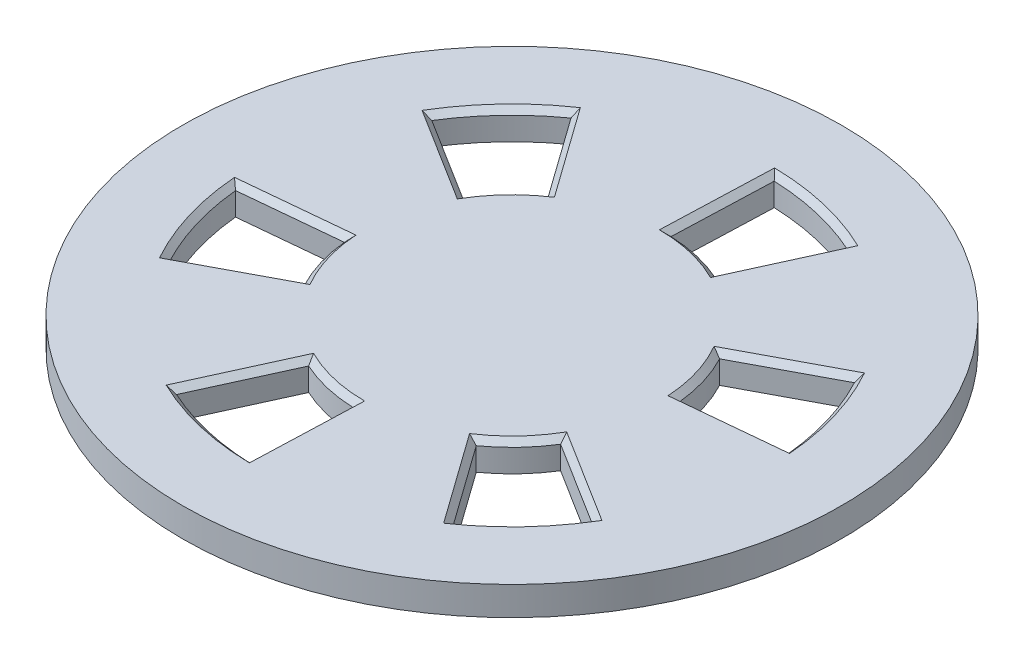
ISO-10303-21;
HEADER;
FILE_DESCRIPTION(('STEP AP214'),'2;1');
FILE_NAME('part.step','',(''),(''),'','','');
FILE_SCHEMA(('AUTOMOTIVE_DESIGN { 1 0 10303 214 1 1 1 1 }'));
ENDSEC;
DATA;
#1=APPLICATION_CONTEXT('core data for automotive mechanical design processes');
#2=APPLICATION_PROTOCOL_DEFINITION('international standard','automotive_design',2000,#1);
#3=PRODUCT_CONTEXT('',#1,'mechanical');
#4=PRODUCT('Part','Part','',(#3));
#5=PRODUCT_RELATED_PRODUCT_CATEGORY('part','',(#4));
#6=PRODUCT_DEFINITION_FORMATION('','',#4);
#7=PRODUCT_DEFINITION_CONTEXT('part definition',#1,'design');
#8=PRODUCT_DEFINITION('design','',#6,#7);
#9=PRODUCT_DEFINITION_SHAPE('','',#8);
#10=(LENGTH_UNIT() NAMED_UNIT(*) SI_UNIT(.MILLI.,.METRE.));
#11=(NAMED_UNIT(*) PLANE_ANGLE_UNIT() SI_UNIT($,.RADIAN.));
#12=(NAMED_UNIT(*) SI_UNIT($,.STERADIAN.) SOLID_ANGLE_UNIT());
#13=UNCERTAINTY_MEASURE_WITH_UNIT(LENGTH_MEASURE(1.E-05),#10,'distance_accuracy_value','');
#14=(GEOMETRIC_REPRESENTATION_CONTEXT(3) GLOBAL_UNCERTAINTY_ASSIGNED_CONTEXT((#13)) GLOBAL_UNIT_ASSIGNED_CONTEXT((#10,
#11,#12)) REPRESENTATION_CONTEXT('',''));
#15=CARTESIAN_POINT('',(0.,0.,0.));
#16=DIRECTION('',(0.,0.,1.));
#17=DIRECTION('',(1.,0.,0.));
#18=AXIS2_PLACEMENT_3D('',#15,#16,#17);
#19=CARTESIAN_POINT('',(0.,12.7,0.));
#20=DIRECTION('',(0.,-1.,0.));
#21=DIRECTION('',(0.,0.,-1.));
#22=AXIS2_PLACEMENT_3D('',#19,#20,#21);
#23=CYLINDRICAL_SURFACE('',#22,145.616242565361);
#24=CARTESIAN_POINT('',(0.,12.7,0.));
#25=DIRECTION('',(0.,1.,0.));
#26=DIRECTION('',(0.,0.,1.));
#27=AXIS2_PLACEMENT_3D('',#24,#25,#26);
#28=CIRCLE('',#27,145.616242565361);
#29=CARTESIAN_POINT('',(0.,12.7,145.616242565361));
#30=VERTEX_POINT('',#29);
#31=EDGE_CURVE('E506',#30,#30,#28,.T.);
#32=ORIENTED_EDGE('',*,*,#31,.F.);
#33=EDGE_LOOP('',(#32));
#34=FACE_BOUND('',#33,.T.);
#35=CARTESIAN_POINT('',(0.,0.,0.));
#36=DIRECTION('',(0.,1.,0.));
#37=DIRECTION('',(0.,0.,1.));
#38=AXIS2_PLACEMENT_3D('',#35,#36,#37);
#39=CIRCLE('',#38,145.616242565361);
#40=CARTESIAN_POINT('',(0.,0.,145.616242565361));
#41=VERTEX_POINT('',#40);
#42=EDGE_CURVE('E508',#41,#41,#39,.T.);
#43=ORIENTED_EDGE('',*,*,#42,.T.);
#44=EDGE_LOOP('',(#43));
#45=FACE_BOUND('',#44,.T.);
#46=ADVANCED_FACE('F37',(#34,#45),#23,.T.);
#47=CARTESIAN_POINT('',(0.,12.7,0.));
#48=DIRECTION('',(0.,1.,0.));
#49=DIRECTION('',(0.,0.,1.));
#50=AXIS2_PLACEMENT_3D('',#47,#48,#49);
#51=PLANE('',#50);
#52=CARTESIAN_POINT('',(0.,12.7,0.));
#53=DIRECTION('',(0.,1.,0.));
#54=DIRECTION('',(0.,0.,1.));
#55=AXIS2_PLACEMENT_3D('',#52,#53,#54);
#56=CIRCLE('',#55,65.3097422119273);
#57=CARTESIAN_POINT('',(29.3543153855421,12.7,-58.3411226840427));
#58=VERTEX_POINT('',#57);
#59=CARTESIAN_POINT('',(-0.189251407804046,12.7,-65.30946800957));
#60=VERTEX_POINT('',#59);
#61=EDGE_CURVE('E477',#58,#60,#56,.T.);
#62=ORIENTED_EDGE('',*,*,#61,.T.);
#63=DIRECTION('',(0.0359958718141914,0.,-0.999351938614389));
#64=VECTOR('',#63,1.);
#65=CARTESIAN_POINT('',(1.49006725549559,12.7,-111.932324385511));
#66=LINE('',#65,#64);
#67=CARTESIAN_POINT('',(1.58048212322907,12.7,-114.442508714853));
#68=VERTEX_POINT('',#67);
#69=EDGE_CURVE('E601',#60,#68,#66,.T.);
#70=ORIENTED_EDGE('',*,*,#69,.T.);
#71=CARTESIAN_POINT('',(0.,12.7,0.));
#72=DIRECTION('',(0.,1.,0.));
#73=DIRECTION('',(0.,0.,1.));
#74=AXIS2_PLACEMENT_3D('',#71,#72,#73);
#75=CIRCLE('',#74,114.453421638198);
#76=CARTESIAN_POINT('',(49.7273254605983,12.7,-103.086268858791));
#77=VERTEX_POINT('',#76);
#78=EDGE_CURVE('E596',#68,#77,#75,.F.);
#79=ORIENTED_EDGE('',*,*,#78,.T.);
#80=DIRECTION('',(-0.41438117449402,0.,0.910103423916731));
#81=VECTOR('',#80,1.);
#82=CARTESIAN_POINT('',(30.4273185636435,12.7,-60.6977545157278));
#83=LINE('',#82,#81);
#84=EDGE_CURVE('E598',#77,#58,#83,.T.);
#85=ORIENTED_EDGE('',*,*,#84,.T.);
#86=EDGE_LOOP('',(#62,#70,#79,#85));
#87=FACE_BOUND('',#86,.T.);
#88=CARTESIAN_POINT('',(0.,12.7,0.));
#89=DIRECTION('',(0.,1.,0.));
#90=DIRECTION('',(0.,0.,1.));
#91=AXIS2_PLACEMENT_3D('',#88,#89,#90);
#92=CIRCLE('',#91,65.3097422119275);
#93=CARTESIAN_POINT('',(-35.8477366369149,12.7,-54.5921441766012));
#94=VERTEX_POINT('',#93);
#95=CARTESIAN_POINT('',(-56.6542841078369,12.7,-32.4908374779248));
#96=VERTEX_POINT('',#95);
#97=EDGE_CURVE('E482',#94,#96,#92,.T.);
#98=ORIENTED_EDGE('',*,*,#97,.T.);
#99=DIRECTION('',(-0.847466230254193,0.,-0.53084930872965));
#100=VECTOR('',#99,1.);
#101=CARTESIAN_POINT('',(-96.1912027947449,12.7,-57.2565982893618));
#102=LINE('',#101,#100);
#103=CARTESIAN_POINT('',(-98.3198787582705,12.7,-58.5899920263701));
#104=VERTEX_POINT('',#103);
#105=EDGE_CURVE('E586',#96,#104,#102,.T.);
#106=ORIENTED_EDGE('',*,*,#105,.T.);
#107=CARTESIAN_POINT('',(0.,12.7,0.));
#108=DIRECTION('',(0.,1.,0.));
#109=DIRECTION('',(0.,0.,1.));
#110=AXIS2_PLACEMENT_3D('',#107,#108,#109);
#111=CIRCLE('',#110,114.453421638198);
#112=CARTESIAN_POINT('',(-64.4116648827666,12.7,-94.6082615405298));
#113=VERTEX_POINT('',#112);
#114=EDGE_CURVE('E581',#104,#113,#111,.F.);
#115=ORIENTED_EDGE('',*,*,#114,.T.);
#116=DIRECTION('',(0.580982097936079,0.,0.813916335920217));
#117=VECTOR('',#116,1.);
#118=CARTESIAN_POINT('',(-37.3521380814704,12.7,-56.6997081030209));
#119=LINE('',#118,#117);
#120=EDGE_CURVE('E583',#113,#94,#119,.T.);
#121=ORIENTED_EDGE('',*,*,#120,.T.);
#122=EDGE_LOOP('',(#98,#106,#115,#121));
#123=FACE_BOUND('',#122,.T.);
#124=CARTESIAN_POINT('',(0.,12.7,0.));
#125=DIRECTION('',(0.,1.,0.));
#126=DIRECTION('',(0.,0.,1.));
#127=AXIS2_PLACEMENT_3D('',#124,#125,#126);
#128=CIRCLE('',#127,65.3097422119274);
#129=CARTESIAN_POINT('',(-65.2020520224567,12.7,3.74897850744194));
#130=VERTEX_POINT('',#129);
#131=CARTESIAN_POINT('',(-56.4650327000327,12.7,32.8186305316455));
#132=VERTEX_POINT('',#131);
#133=EDGE_CURVE('E487',#130,#132,#128,.T.);
#134=ORIENTED_EDGE('',*,*,#133,.T.);
#135=DIRECTION('',(-0.883462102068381,0.,0.46850262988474));
#136=VECTOR('',#135,1.);
#137=CARTESIAN_POINT('',(-97.6812700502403,12.7,54.6757260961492));
#138=LINE('',#137,#136);
#139=CARTESIAN_POINT('',(-99.9003608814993,12.7,55.8525166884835));
#140=VERTEX_POINT('',#139);
#141=EDGE_CURVE('E570',#132,#140,#138,.T.);
#142=ORIENTED_EDGE('',*,*,#141,.T.);
#143=CARTESIAN_POINT('',(0.,12.7,0.));
#144=DIRECTION('',(0.,1.,0.));
#145=DIRECTION('',(0.,0.,1.));
#146=AXIS2_PLACEMENT_3D('',#143,#144,#145);
#147=CIRCLE('',#146,114.453421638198);
#148=CARTESIAN_POINT('',(-114.138990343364,12.7,8.47800731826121));
#149=VERTEX_POINT('',#148);
#150=EDGE_CURVE('E565',#140,#149,#147,.F.);
#151=ORIENTED_EDGE('',*,*,#150,.T.);
#152=DIRECTION('',(0.995363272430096,0.,-0.0961870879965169));
#153=VECTOR('',#152,1.);
#154=CARTESIAN_POINT('',(-67.7794566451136,12.7,3.99804641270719));
#155=LINE('',#154,#153);
#156=EDGE_CURVE('E567',#149,#130,#155,.T.);
#157=ORIENTED_EDGE('',*,*,#156,.T.);
#158=EDGE_LOOP('',(#134,#142,#151,#157));
#159=FACE_BOUND('',#158,.T.);
#160=CARTESIAN_POINT('',(0.,12.7,0.));
#161=DIRECTION('',(0.,1.,0.));
#162=DIRECTION('',(0.,0.,1.));
#163=AXIS2_PLACEMENT_3D('',#160,#161,#162);
#164=CIRCLE('',#163,65.3097422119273);
#165=CARTESIAN_POINT('',(-29.3543153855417,12.7,58.3411226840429));
#166=VERTEX_POINT('',#165);
#167=CARTESIAN_POINT('',(0.189251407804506,12.7,65.30946800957));
#168=VERTEX_POINT('',#167);
#169=EDGE_CURVE('E492',#166,#168,#164,.T.);
#170=ORIENTED_EDGE('',*,*,#169,.T.);
#171=DIRECTION('',(-0.0359958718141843,0.,0.999351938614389));
#172=VECTOR('',#171,1.);
#173=CARTESIAN_POINT('',(-1.4900672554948,12.7,111.932324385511));
#174=LINE('',#173,#172);
#175=CARTESIAN_POINT('',(-1.58048212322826,12.7,114.442508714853));
#176=VERTEX_POINT('',#175);
#177=EDGE_CURVE('E554',#168,#176,#174,.T.);
#178=ORIENTED_EDGE('',*,*,#177,.T.);
#179=CARTESIAN_POINT('',(0.,12.7,0.));
#180=DIRECTION('',(0.,1.,0.));
#181=DIRECTION('',(0.,0.,1.));
#182=AXIS2_PLACEMENT_3D('',#179,#180,#181);
#183=CIRCLE('',#182,114.453421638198);
#184=CARTESIAN_POINT('',(-49.7273254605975,12.7,103.086268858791));
#185=VERTEX_POINT('',#184);
#186=EDGE_CURVE('E549',#176,#185,#183,.F.);
#187=ORIENTED_EDGE('',*,*,#186,.T.);
#188=DIRECTION('',(0.414381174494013,0.,-0.910103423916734));
#189=VECTOR('',#188,1.);
#190=CARTESIAN_POINT('',(-30.4273185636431,12.7,60.697754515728));
#191=LINE('',#190,#189);
#192=EDGE_CURVE('E551',#185,#166,#191,.T.);
#193=ORIENTED_EDGE('',*,*,#192,.T.);
#194=EDGE_LOOP('',(#170,#178,#187,#193));
#195=FACE_BOUND('',#194,.T.);
#196=CARTESIAN_POINT('',(0.,12.7,0.));
#197=DIRECTION('',(0.,1.,0.));
#198=DIRECTION('',(0.,0.,1.));
#199=AXIS2_PLACEMENT_3D('',#196,#197,#198);
#200=CIRCLE('',#199,65.3097422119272);
#201=CARTESIAN_POINT('',(35.8477366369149,12.7,54.5921441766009));
#202=VERTEX_POINT('',#201);
#203=CARTESIAN_POINT('',(56.654284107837,12.7,32.4908374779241));
#204=VERTEX_POINT('',#203);
#205=EDGE_CURVE('E497',#202,#204,#200,.T.);
#206=ORIENTED_EDGE('',*,*,#205,.T.);
#207=DIRECTION('',(0.847466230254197,0.,0.530849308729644));
#208=VECTOR('',#207,1.);
#209=CARTESIAN_POINT('',(96.1912027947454,12.7,57.2565982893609));
#210=LINE('',#209,#208);
#211=CARTESIAN_POINT('',(98.3198787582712,12.7,58.5899920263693));
#212=VERTEX_POINT('',#211);
#213=EDGE_CURVE('E538',#204,#212,#210,.T.);
#214=ORIENTED_EDGE('',*,*,#213,.T.);
#215=CARTESIAN_POINT('',(0.,12.7,0.));
#216=DIRECTION('',(0.,1.,0.));
#217=DIRECTION('',(0.,0.,1.));
#218=AXIS2_PLACEMENT_3D('',#215,#216,#217);
#219=CIRCLE('',#218,114.453421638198);
#220=CARTESIAN_POINT('',(64.4116648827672,12.7,94.6082615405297));
#221=VERTEX_POINT('',#220);
#222=EDGE_CURVE('E533',#212,#221,#219,.F.);
#223=ORIENTED_EDGE('',*,*,#222,.T.);
#224=DIRECTION('',(-0.580982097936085,0.,-0.813916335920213));
#225=VECTOR('',#224,1.);
#226=CARTESIAN_POINT('',(37.3521380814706,12.7,56.6997081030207));
#227=LINE('',#226,#225);
#228=EDGE_CURVE('E535',#221,#202,#227,.T.);
#229=ORIENTED_EDGE('',*,*,#228,.T.);
#230=EDGE_LOOP('',(#206,#214,#223,#229));
#231=FACE_BOUND('',#230,.T.);
#232=CARTESIAN_POINT('',(0.,12.7,0.));
#233=DIRECTION('',(0.,1.,0.));
#234=DIRECTION('',(0.,0.,1.));
#235=AXIS2_PLACEMENT_3D('',#232,#233,#234);
#236=CIRCLE('',#235,65.3097422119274);
#237=CARTESIAN_POINT('',(65.2020520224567,12.7,-3.74897850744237));
#238=VERTEX_POINT('',#237);
#239=CARTESIAN_POINT('',(56.4650327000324,12.7,-32.8186305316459));
#240=VERTEX_POINT('',#239);
#241=EDGE_CURVE('E502',#238,#240,#236,.T.);
#242=ORIENTED_EDGE('',*,*,#241,.T.);
#243=DIRECTION('',(0.883462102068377,0.,-0.468502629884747));
#244=VECTOR('',#243,1.);
#245=CARTESIAN_POINT('',(97.6812700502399,12.7,-54.6757260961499));
#246=LINE('',#245,#244);
#247=CARTESIAN_POINT('',(99.9003608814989,12.7,-55.8525166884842));
#248=VERTEX_POINT('',#247);
#249=EDGE_CURVE('E522',#240,#248,#246,.T.);
#250=ORIENTED_EDGE('',*,*,#249,.T.);
#251=CARTESIAN_POINT('',(0.,12.7,0.));
#252=DIRECTION('',(0.,1.,0.));
#253=DIRECTION('',(0.,0.,1.));
#254=AXIS2_PLACEMENT_3D('',#251,#252,#253);
#255=CIRCLE('',#254,114.453421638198);
#256=CARTESIAN_POINT('',(114.138990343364,12.7,-8.47800731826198));
#257=VERTEX_POINT('',#256);
#258=EDGE_CURVE('E511',#248,#257,#255,.F.);
#259=ORIENTED_EDGE('',*,*,#258,.T.);
#260=DIRECTION('',(-0.995363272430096,0.,0.0961870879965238));
#261=VECTOR('',#260,1.);
#262=CARTESIAN_POINT('',(67.7794566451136,12.7,-3.99804641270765));
#263=LINE('',#262,#261);
#264=EDGE_CURVE('E519',#257,#238,#263,.T.);
#265=ORIENTED_EDGE('',*,*,#264,.T.);
#266=EDGE_LOOP('',(#242,#250,#259,#265));
#267=FACE_BOUND('',#266,.T.);
#268=ORIENTED_EDGE('',*,*,#31,.T.);
#269=EDGE_LOOP('',(#268));
#270=FACE_BOUND('',#269,.T.);
#271=ADVANCED_FACE('F466',(#87,#123,#159,#195,#231,#267,#270),#51,.T.);
#272=CARTESIAN_POINT('',(0.,0.,0.));
#273=DIRECTION('',(0.,1.,0.));
#274=DIRECTION('',(0.,0.,1.));
#275=AXIS2_PLACEMENT_3D('',#272,#273,#274);
#276=PLANE('',#275);
#277=DIRECTION('',(0.41438117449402,0.,-0.910103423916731));
#278=VECTOR('',#277,1.);
#279=CARTESIAN_POINT('',(28.115655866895,0.,-61.7502826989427));
#280=LINE('',#279,#278);
#281=CARTESIAN_POINT('',(28.115655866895,0.,-61.7502826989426));
#282=VERTEX_POINT('',#281);
#283=CARTESIAN_POINT('',(46.374815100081,0.,-101.852788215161));
#284=VERTEX_POINT('',#283);
#285=EDGE_CURVE('E280',#282,#284,#280,.T.);
#286=ORIENTED_EDGE('',*,*,#285,.T.);
#287=CARTESIAN_POINT('',(0.,0.,0.));
#288=DIRECTION('',(0.,1.,0.));
#289=DIRECTION('',(0.866025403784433,0.,0.50000000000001));
#290=AXIS2_PLACEMENT_3D('',#287,#288,#289);
#291=CIRCLE('',#290,111.913421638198);
#292=CARTESIAN_POINT('',(4.02842117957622,0.,-111.840894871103));
#293=VERTEX_POINT('',#292);
#294=EDGE_CURVE('E273',#284,#293,#291,.T.);
#295=ORIENTED_EDGE('',*,*,#294,.T.);
#296=DIRECTION('',(-0.0359958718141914,0.,0.999351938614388));
#297=VECTOR('',#296,1.);
#298=CARTESIAN_POINT('',(4.02842117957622,0.,-111.840894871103));
#299=LINE('',#298,#297);
#300=CARTESIAN_POINT('',(2.44231062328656,0.,-67.8057714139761));
#301=VERTEX_POINT('',#300);
#302=EDGE_CURVE('E284',#293,#301,#299,.T.);
#303=ORIENTED_EDGE('',*,*,#302,.T.);
#304=CARTESIAN_POINT('',(0.,0.,0.));
#305=DIRECTION('',(0.,-1.,0.));
#306=DIRECTION('',(0.866025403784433,0.,0.50000000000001));
#307=AXIS2_PLACEMENT_3D('',#304,#305,#306);
#308=CIRCLE('',#307,67.8497422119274);
#309=EDGE_CURVE('E288',#301,#282,#308,.T.);
#310=ORIENTED_EDGE('',*,*,#309,.T.);
#311=EDGE_LOOP('',(#286,#295,#303,#310));
#312=FACE_BOUND('',#311,.T.);
#313=DIRECTION('',(-0.580982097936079,0.,-0.813916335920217));
#314=VECTOR('',#313,1.);
#315=CARTESIAN_POINT('',(-39.4194855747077,0.,-55.2240135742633));
#316=LINE('',#315,#314);
#317=CARTESIAN_POINT('',(-39.4194855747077,0.,-55.2240135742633));
#318=VERTEX_POINT('',#317);
#319=CARTESIAN_POINT('',(-65.0196944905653,0.,-91.0881620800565));
#320=VERTEX_POINT('',#319);
#321=EDGE_CURVE('E321',#318,#320,#316,.T.);
#322=ORIENTED_EDGE('',*,*,#321,.T.);
#323=CARTESIAN_POINT('',(0.,0.,0.));
#324=DIRECTION('',(0.,1.,0.));
#325=DIRECTION('',(0.866025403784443,0.,-0.499999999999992));
#326=AXIS2_PLACEMENT_3D('',#323,#324,#325);
#327=CIRCLE('',#326,111.913421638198);
#328=CARTESIAN_POINT('',(-94.8428455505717,0.,-59.4091625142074));
#329=VERTEX_POINT('',#328);
#330=EDGE_CURVE('E309',#320,#329,#327,.T.);
#331=ORIENTED_EDGE('',*,*,#330,.T.);
#332=DIRECTION('',(0.847466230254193,0.,0.53084930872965));
#333=VECTOR('',#332,1.);
#334=CARTESIAN_POINT('',(-94.8428455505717,0.,-59.4091625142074));
#335=LINE('',#334,#333);
#336=CARTESIAN_POINT('',(-57.5003652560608,0.,-36.0179887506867));
#337=VERTEX_POINT('',#336);
#338=EDGE_CURVE('E315',#329,#337,#335,.T.);
#339=ORIENTED_EDGE('',*,*,#338,.T.);
#340=CARTESIAN_POINT('',(0.,0.,0.));
#341=DIRECTION('',(0.,-1.,0.));
#342=DIRECTION('',(0.866025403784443,0.,-0.499999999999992));
#343=AXIS2_PLACEMENT_3D('',#340,#341,#342);
#344=CIRCLE('',#343,67.8497422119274);
#345=EDGE_CURVE('E318',#337,#318,#344,.T.);
#346=ORIENTED_EDGE('',*,*,#345,.T.);
#347=EDGE_LOOP('',(#322,#331,#339,#346));
#348=FACE_BOUND('',#347,.T.);
#349=DIRECTION('',(-0.995363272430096,0.,0.0961870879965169));
#350=VECTOR('',#349,1.);
#351=CARTESIAN_POINT('',(-67.5351414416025,0.,6.52626912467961));
#352=LINE('',#351,#350);
#353=CARTESIAN_POINT('',(-67.5351414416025,0.,6.5262691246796));
#354=VERTEX_POINT('',#353);
#355=CARTESIAN_POINT('',(-111.394509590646,0.,10.7646261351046));
#356=VERTEX_POINT('',#355);
#357=EDGE_CURVE('E345',#354,#356,#352,.T.);
#358=ORIENTED_EDGE('',*,*,#357,.T.);
#359=CARTESIAN_POINT('',(0.,0.,0.));
#360=DIRECTION('',(0.,1.,0.));
#361=DIRECTION('',(0.,0.,-1.));
#362=AXIS2_PLACEMENT_3D('',#359,#360,#361);
#363=CIRCLE('',#362,111.913421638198);
#364=CARTESIAN_POINT('',(-98.8712667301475,0.,52.4317323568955));
#365=VERTEX_POINT('',#364);
#366=EDGE_CURVE('E328',#356,#365,#363,.T.);
#367=ORIENTED_EDGE('',*,*,#366,.T.);
#368=DIRECTION('',(0.883462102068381,0.,-0.46850262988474));
#369=VECTOR('',#368,1.);
#370=CARTESIAN_POINT('',(-98.8712667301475,0.,52.4317323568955));
#371=LINE('',#370,#369);
#372=CARTESIAN_POINT('',(-59.9426758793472,0.,31.7877826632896));
#373=VERTEX_POINT('',#372);
#374=EDGE_CURVE('E339',#365,#373,#371,.T.);
#375=ORIENTED_EDGE('',*,*,#374,.T.);
#376=CARTESIAN_POINT('',(0.,0.,0.));
#377=DIRECTION('',(0.,-1.,0.));
#378=DIRECTION('',(0.,0.,-1.));
#379=AXIS2_PLACEMENT_3D('',#376,#377,#378);
#380=CIRCLE('',#379,67.8497422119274);
#381=EDGE_CURVE('E342',#373,#354,#380,.T.);
#382=ORIENTED_EDGE('',*,*,#381,.T.);
#383=EDGE_LOOP('',(#358,#367,#375,#382));
#384=FACE_BOUND('',#383,.T.);
#385=DIRECTION('',(-0.414381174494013,0.,0.910103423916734));
#386=VECTOR('',#385,1.);
#387=CARTESIAN_POINT('',(-28.1156558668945,0.,61.7502826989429));
#388=LINE('',#387,#386);
#389=CARTESIAN_POINT('',(-28.1156558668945,0.,61.7502826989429));
#390=VERTEX_POINT('',#389);
#391=CARTESIAN_POINT('',(-46.3748151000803,0.,101.852788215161));
#392=VERTEX_POINT('',#391);
#393=EDGE_CURVE('E369',#390,#392,#388,.T.);
#394=ORIENTED_EDGE('',*,*,#393,.T.);
#395=CARTESIAN_POINT('',(0.,0.,0.));
#396=DIRECTION('',(0.,1.,0.));
#397=DIRECTION('',(-0.866025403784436,0.,-0.500000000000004));
#398=AXIS2_PLACEMENT_3D('',#395,#396,#397);
#399=CIRCLE('',#398,111.913421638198);
#400=CARTESIAN_POINT('',(-4.02842117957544,0.,111.840894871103));
#401=VERTEX_POINT('',#400);
#402=EDGE_CURVE('E352',#392,#401,#399,.T.);
#403=ORIENTED_EDGE('',*,*,#402,.T.);
#404=DIRECTION('',(0.0359958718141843,0.,-0.999351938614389));
#405=VECTOR('',#404,1.);
#406=CARTESIAN_POINT('',(-4.02842117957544,0.,111.840894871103));
#407=LINE('',#406,#405);
#408=CARTESIAN_POINT('',(-2.44231062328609,0.,67.8057714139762));
#409=VERTEX_POINT('',#408);
#410=EDGE_CURVE('E363',#401,#409,#407,.T.);
#411=ORIENTED_EDGE('',*,*,#410,.T.);
#412=CARTESIAN_POINT('',(0.,0.,0.));
#413=DIRECTION('',(0.,-1.,0.));
#414=DIRECTION('',(-0.866025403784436,0.,-0.500000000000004));
#415=AXIS2_PLACEMENT_3D('',#412,#413,#414);
#416=CIRCLE('',#415,67.8497422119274);
#417=EDGE_CURVE('E366',#409,#390,#416,.T.);
#418=ORIENTED_EDGE('',*,*,#417,.T.);
#419=EDGE_LOOP('',(#394,#403,#411,#418));
#420=FACE_BOUND('',#419,.T.);
#421=DIRECTION('',(0.580982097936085,0.,0.813916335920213));
#422=VECTOR('',#421,1.);
#423=CARTESIAN_POINT('',(39.4194855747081,0.,55.224013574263));
#424=LINE('',#423,#422);
#425=CARTESIAN_POINT('',(39.4194855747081,0.,55.224013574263));
#426=VERTEX_POINT('',#425);
#427=CARTESIAN_POINT('',(65.0196944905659,0.,91.0881620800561));
#428=VERTEX_POINT('',#427);
#429=EDGE_CURVE('E393',#426,#428,#424,.T.);
#430=ORIENTED_EDGE('',*,*,#429,.T.);
#431=CARTESIAN_POINT('',(0.,0.,0.));
#432=DIRECTION('',(0.,1.,0.));
#433=DIRECTION('',(-0.86602540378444,0.,0.499999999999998));
#434=AXIS2_PLACEMENT_3D('',#431,#432,#433);
#435=CIRCLE('',#434,111.913421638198);
#436=CARTESIAN_POINT('',(94.8428455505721,0.,59.4091625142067));
#437=VERTEX_POINT('',#436);
#438=EDGE_CURVE('E376',#428,#437,#435,.T.);
#439=ORIENTED_EDGE('',*,*,#438,.T.);
#440=DIRECTION('',(-0.847466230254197,0.,-0.530849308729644));
#441=VECTOR('',#440,1.);
#442=CARTESIAN_POINT('',(94.8428455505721,0.,59.4091625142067));
#443=LINE('',#442,#441);
#444=CARTESIAN_POINT('',(57.5003652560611,0.,36.0179887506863));
#445=VERTEX_POINT('',#444);
#446=EDGE_CURVE('E387',#437,#445,#443,.T.);
#447=ORIENTED_EDGE('',*,*,#446,.T.);
#448=CARTESIAN_POINT('',(0.,0.,0.));
#449=DIRECTION('',(0.,-1.,0.));
#450=DIRECTION('',(-0.86602540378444,0.,0.499999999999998));
#451=AXIS2_PLACEMENT_3D('',#448,#449,#450);
#452=CIRCLE('',#451,67.8497422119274);
#453=EDGE_CURVE('E390',#445,#426,#452,.T.);
#454=ORIENTED_EDGE('',*,*,#453,.T.);
#455=EDGE_LOOP('',(#430,#439,#447,#454));
#456=FACE_BOUND('',#455,.T.);
#457=DIRECTION('',(0.995363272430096,0.,-0.0961870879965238));
#458=VECTOR('',#457,1.);
#459=CARTESIAN_POINT('',(67.5351414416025,0.,-6.52626912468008));
#460=LINE('',#459,#458);
#461=CARTESIAN_POINT('',(67.5351414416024,0.,-6.52626912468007));
#462=VERTEX_POINT('',#461);
#463=CARTESIAN_POINT('',(111.394509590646,0.,-10.7646261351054));
#464=VERTEX_POINT('',#463);
#465=EDGE_CURVE('E894',#462,#464,#460,.T.);
#466=ORIENTED_EDGE('',*,*,#465,.T.);
#467=CARTESIAN_POINT('',(0.,0.,0.));
#468=DIRECTION('',(0.,1.,0.));
#469=DIRECTION('',(0.,0.,1.));
#470=AXIS2_PLACEMENT_3D('',#467,#468,#469);
#471=CIRCLE('',#470,111.913421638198);
#472=CARTESIAN_POINT('',(98.8712667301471,0.,-52.4317323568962));
#473=VERTEX_POINT('',#472);
#474=EDGE_CURVE('E899',#464,#473,#471,.T.);
#475=ORIENTED_EDGE('',*,*,#474,.T.);
#476=DIRECTION('',(-0.883462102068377,0.,0.468502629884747));
#477=VECTOR('',#476,1.);
#478=CARTESIAN_POINT('',(98.8712667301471,0.,-52.4317323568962));
#479=LINE('',#478,#477);
#480=CARTESIAN_POINT('',(59.942675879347,0.,-31.78778266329));
#481=VERTEX_POINT('',#480);
#482=EDGE_CURVE('E906',#473,#481,#479,.T.);
#483=ORIENTED_EDGE('',*,*,#482,.T.);
#484=CARTESIAN_POINT('',(0.,0.,0.));
#485=DIRECTION('',(0.,-1.,0.));
#486=DIRECTION('',(0.,0.,1.));
#487=AXIS2_PLACEMENT_3D('',#484,#485,#486);
#488=CIRCLE('',#487,67.8497422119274);
#489=EDGE_CURVE('E900',#481,#462,#488,.T.);
#490=ORIENTED_EDGE('',*,*,#489,.T.);
#491=EDGE_LOOP('',(#466,#475,#483,#490));
#492=FACE_BOUND('',#491,.T.);
#493=ORIENTED_EDGE('',*,*,#42,.F.);
#494=EDGE_LOOP('',(#493));
#495=FACE_BOUND('',#494,.T.);
#496=ADVANCED_FACE('F290',(#312,#348,#384,#420,#456,#492,#495),#276,.F.);
#497=CARTESIAN_POINT('',(0.,0.,0.));
#498=DIRECTION('',(0.,1.,0.));
#499=DIRECTION('',(0.,0.,1.));
#500=AXIS2_PLACEMENT_3D('',#497,#498,#499);
#501=CYLINDRICAL_SURFACE('',#500,111.913421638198);
#502=DIRECTION('',(0.,1.,0.));
#503=VECTOR('',#502,1.);
#504=CARTESIAN_POINT('',(111.394509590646,0.,-10.7646261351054));
#505=LINE('',#504,#503);
#506=CARTESIAN_POINT('',(111.394509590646,10.16,-10.7646261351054));
#507=VERTEX_POINT('',#506);
#508=EDGE_CURVE('E514',#464,#507,#505,.T.);
#509=ORIENTED_EDGE('',*,*,#508,.T.);
#510=CARTESIAN_POINT('',(0.,10.16,0.));
#511=DIRECTION('',(0.,1.,0.));
#512=DIRECTION('',(0.,0.,1.));
#513=AXIS2_PLACEMENT_3D('',#510,#511,#512);
#514=CIRCLE('',#513,111.913421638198);
#515=CARTESIAN_POINT('',(98.8712667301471,10.16,-52.4317323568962));
#516=VERTEX_POINT('',#515);
#517=EDGE_CURVE('E528',#507,#516,#514,.T.);
#518=ORIENTED_EDGE('',*,*,#517,.T.);
#519=DIRECTION('',(0.,1.,0.));
#520=VECTOR('',#519,1.);
#521=CARTESIAN_POINT('',(98.8712667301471,0.,-52.4317323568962));
#522=LINE('',#521,#520);
#523=EDGE_CURVE('E902',#473,#516,#522,.T.);
#524=ORIENTED_EDGE('',*,*,#523,.F.);
#525=ORIENTED_EDGE('',*,*,#474,.F.);
#526=EDGE_LOOP('',(#509,#518,#524,#525));
#527=FACE_BOUND('',#526,.T.);
#528=ADVANCED_FACE('F454',(#527),#501,.F.);
#529=CARTESIAN_POINT('',(67.5351414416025,0.,-6.52626912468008));
#530=DIRECTION('',(0.0961870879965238,0.,0.995363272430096));
#531=DIRECTION('',(0.995363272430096,0.,-0.0961870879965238));
#532=AXIS2_PLACEMENT_3D('',#529,#530,#531);
#533=PLANE('',#532);
#534=DIRECTION('',(0.,1.,0.));
#535=VECTOR('',#534,1.);
#536=CARTESIAN_POINT('',(67.5351414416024,0.,-6.52626912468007));
#537=LINE('',#536,#535);
#538=CARTESIAN_POINT('',(67.5351414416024,10.16,-6.52626912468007));
#539=VERTEX_POINT('',#538);
#540=EDGE_CURVE('E912',#462,#539,#537,.T.);
#541=ORIENTED_EDGE('',*,*,#540,.T.);
#542=DIRECTION('',(0.995363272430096,0.,-0.0961870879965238));
#543=VECTOR('',#542,1.);
#544=CARTESIAN_POINT('',(111.394509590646,10.16,-10.7646261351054));
#545=LINE('',#544,#543);
#546=EDGE_CURVE('E526',#539,#507,#545,.T.);
#547=ORIENTED_EDGE('',*,*,#546,.T.);
#548=ORIENTED_EDGE('',*,*,#508,.F.);
#549=ORIENTED_EDGE('',*,*,#465,.F.);
#550=EDGE_LOOP('',(#541,#547,#548,#549));
#551=FACE_BOUND('',#550,.T.);
#552=ADVANCED_FACE('F449',(#551),#533,.F.);
#553=CARTESIAN_POINT('',(0.,0.,0.));
#554=DIRECTION('',(0.,1.,0.));
#555=DIRECTION('',(0.,0.,1.));
#556=AXIS2_PLACEMENT_3D('',#553,#554,#555);
#557=CYLINDRICAL_SURFACE('',#556,67.8497422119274);
#558=DIRECTION('',(0.,1.,0.));
#559=VECTOR('',#558,1.);
#560=CARTESIAN_POINT('',(59.9426758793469,0.,-31.78778266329));
#561=LINE('',#560,#559);
#562=CARTESIAN_POINT('',(59.9426758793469,10.16,-31.78778266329));
#563=VERTEX_POINT('',#562);
#564=EDGE_CURVE('E905',#481,#563,#561,.T.);
#565=ORIENTED_EDGE('',*,*,#564,.T.);
#566=CARTESIAN_POINT('',(0.,10.16,0.));
#567=DIRECTION('',(0.,1.,0.));
#568=DIRECTION('',(0.,0.,1.));
#569=AXIS2_PLACEMENT_3D('',#566,#567,#568);
#570=CIRCLE('',#569,67.8497422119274);
#571=EDGE_CURVE('E524',#563,#539,#570,.F.);
#572=ORIENTED_EDGE('',*,*,#571,.T.);
#573=ORIENTED_EDGE('',*,*,#540,.F.);
#574=ORIENTED_EDGE('',*,*,#489,.F.);
#575=EDGE_LOOP('',(#565,#572,#573,#574));
#576=FACE_BOUND('',#575,.T.);
#577=ADVANCED_FACE('F453',(#576),#557,.T.);
#578=CARTESIAN_POINT('',(98.8712667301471,0.,-52.4317323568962));
#579=DIRECTION('',(-0.468502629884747,0.,-0.883462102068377));
#580=DIRECTION('',(-0.883462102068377,0.,0.468502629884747));
#581=AXIS2_PLACEMENT_3D('',#578,#579,#580);
#582=PLANE('',#581);
#583=ORIENTED_EDGE('',*,*,#523,.T.);
#584=DIRECTION('',(-0.883462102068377,0.,0.468502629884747));
#585=VECTOR('',#584,1.);
#586=CARTESIAN_POINT('',(59.9426758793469,10.16,-31.78778266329));
#587=LINE('',#586,#585);
#588=EDGE_CURVE('E507',#516,#563,#587,.T.);
#589=ORIENTED_EDGE('',*,*,#588,.T.);
#590=ORIENTED_EDGE('',*,*,#564,.F.);
#591=ORIENTED_EDGE('',*,*,#482,.F.);
#592=EDGE_LOOP('',(#583,#589,#590,#591));
#593=FACE_BOUND('',#592,.T.);
#594=ADVANCED_FACE('F447',(#593),#582,.F.);
#595=CARTESIAN_POINT('',(67.5351414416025,10.16,-6.52626912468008));
#596=DIRECTION('',(-0.0680145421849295,0.707106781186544,-0.703828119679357));
#597=DIRECTION('',(0.,0.705461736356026,0.708748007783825));
#598=AXIS2_PLACEMENT_3D('',#595,#596,#597);
#599=PLANE('',#598);
#600=CARTESIAN_POINT('',(67.5351414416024,10.16,-6.52626912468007));
#601=CARTESIAN_POINT('',(67.3435689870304,10.3730531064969,-6.2937109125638));
#602=CARTESIAN_POINT('',(67.1512986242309,10.5857719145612,-6.0614211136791));
#603=CARTESIAN_POINT('',(66.7653430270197,11.0105188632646,-5.59739867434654));
#604=CARTESIAN_POINT('',(66.5716578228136,11.2225470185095,-5.36566602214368));
#605=CARTESIAN_POINT('',(66.1828451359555,11.6458998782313,-4.90276807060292));
#606=CARTESIAN_POINT('',(65.9877176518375,11.8572245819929,-4.67160277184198));
#607=CARTESIAN_POINT('',(65.5959924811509,12.279156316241,-4.20985111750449));
#608=CARTESIAN_POINT('',(65.3993947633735,12.4897633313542,-3.97926477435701));
#609=CARTESIAN_POINT('',(65.2020520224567,12.7,-3.74897850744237));
#610=B_SPLINE_CURVE_WITH_KNOTS('',3,(#600,#601,#602,#603,#604,#605,#606,#607,#608,#609),
.UNSPECIFIED.,.F.,.F.,(4,2,2,2,4),(0.,1.1070560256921,2.21408848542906,3.32112207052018,
4.42817922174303),.UNSPECIFIED.);
#611=EDGE_CURVE('E432',#238,#539,#610,.F.);
#612=ORIENTED_EDGE('',*,*,#611,.F.);
#613=ORIENTED_EDGE('',*,*,#264,.F.);
#614=CARTESIAN_POINT('',(111.394509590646,10.16,-10.7646261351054));
#615=CARTESIAN_POINT('',(111.854880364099,10.5817906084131,-10.3853586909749));
#616=CARTESIAN_POINT('',(112.313772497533,11.0043525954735,-10.0051733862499));
#617=CARTESIAN_POINT('',(113.228599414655,11.8510192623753,-9.24296711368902));
#618=CARTESIAN_POINT('',(113.684534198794,12.2751239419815,-8.86094614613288));
#619=CARTESIAN_POINT('',(114.138990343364,12.7,-8.47800731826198));
#620=B_SPLINE_CURVE_WITH_KNOTS('',3,(#614,#615,#616,#617,#618,#619),.UNSPECIFIED.,.F.,.F.,(4,2,
4),(0.,2.19160521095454,4.38321008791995),.UNSPECIFIED.);
#621=EDGE_CURVE('E438',#507,#257,#620,.T.);
#622=ORIENTED_EDGE('',*,*,#621,.F.);
#623=ORIENTED_EDGE('',*,*,#546,.F.);
#624=EDGE_LOOP('',(#612,#613,#622,#623));
#625=FACE_BOUND('',#624,.T.);
#626=ADVANCED_FACE('F443',(#625),#599,.T.);
#627=CARTESIAN_POINT('',(0.,10.16,0.));
#628=DIRECTION('',(0.,1.,0.));
#629=DIRECTION('',(0.,0.,1.));
#630=AXIS2_PLACEMENT_3D('',#627,#628,#629);
#631=CONICAL_SURFACE('',#630,111.913421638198,0.785398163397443);
#632=ORIENTED_EDGE('',*,*,#621,.T.);
#633=ORIENTED_EDGE('',*,*,#258,.F.);
#634=CARTESIAN_POINT('',(99.900360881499,12.7,-55.8525166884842));
#635=CARTESIAN_POINT('',(99.7323245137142,12.2751239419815,-55.2824848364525));
#636=CARTESIAN_POINT('',(99.5625484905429,11.8510192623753,-54.7124035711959));
#637=CARTESIAN_POINT('',(99.2195171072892,11.0043525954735,-53.5721421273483));
#638=CARTESIAN_POINT('',(99.0462617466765,10.5817906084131,-53.0019619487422));
#639=CARTESIAN_POINT('',(98.8712667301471,10.16,-52.4317323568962));
#640=B_SPLINE_CURVE_WITH_KNOTS('',3,(#634,#635,#636,#637,#638,#639),.UNSPECIFIED.,.F.,.F.,(4,2,
4),(0.,2.19160487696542,4.38321008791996),.UNSPECIFIED.);
#641=EDGE_CURVE('E415',#516,#248,#640,.F.);
#642=ORIENTED_EDGE('',*,*,#641,.F.);
#643=ORIENTED_EDGE('',*,*,#517,.F.);
#644=EDGE_LOOP('',(#632,#633,#642,#643));
#645=FACE_BOUND('',#644,.T.);
#646=ADVANCED_FACE('F427',(#645),#631,.F.);
#647=CARTESIAN_POINT('',(0.,10.16,0.));
#648=DIRECTION('',(0.,-1.,0.));
#649=DIRECTION('',(0.,0.,-1.));
#650=AXIS2_PLACEMENT_3D('',#647,#648,#649);
#651=CONICAL_SURFACE('',#650,67.8497422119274,0.785398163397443);
#652=ORIENTED_EDGE('',*,*,#611,.T.);
#653=ORIENTED_EDGE('',*,*,#571,.F.);
#654=CARTESIAN_POINT('',(59.9426758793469,10.16,-31.78778266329));
#655=CARTESIAN_POINT('',(59.6546354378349,10.3730531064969,-31.8761909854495));
#656=CARTESIAN_POINT('',(59.3661607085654,10.5857719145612,-31.9639906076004));
#657=CARTESIAN_POINT('',(58.7883379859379,11.0105188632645,-32.1383449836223));
#658=CARTESIAN_POINT('',(58.4989900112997,11.2225470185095,-32.2248997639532));
#659=CARTESIAN_POINT('',(57.9194035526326,11.6458998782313,-32.3967408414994));
#660=CARTESIAN_POINT('',(57.6291650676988,11.8572245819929,-32.4820271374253));
#661=CARTESIAN_POINT('',(57.0477806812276,12.279156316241,-32.651306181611));
#662=CARTESIAN_POINT('',(56.756634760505,12.4897633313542,-32.7352989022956));
#663=CARTESIAN_POINT('',(56.4650327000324,12.7,-32.8186305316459));
#664=B_SPLINE_CURVE_WITH_KNOTS('',3,(#654,#655,#656,#657,#658,#659,#660,#661,#662,#663),
.UNSPECIFIED.,.F.,.F.,(4,2,2,2,4),(0.,1.1070560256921,2.21408848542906,3.3211220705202,
4.42817922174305),.UNSPECIFIED.);
#665=EDGE_CURVE('E400',#240,#563,#664,.F.);
#666=ORIENTED_EDGE('',*,*,#665,.F.);
#667=ORIENTED_EDGE('',*,*,#241,.F.);
#668=EDGE_LOOP('',(#652,#653,#666,#667));
#669=FACE_BOUND('',#668,.T.);
#670=ADVANCED_FACE('F424',(#669),#651,.T.);
#671=CARTESIAN_POINT('',(98.8712667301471,10.16,-52.4317323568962));
#672=DIRECTION('',(0.331281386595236,0.707106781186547,0.624702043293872));
#673=DIRECTION('',(0.,-0.662088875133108,0.749425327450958));
#674=AXIS2_PLACEMENT_3D('',#671,#672,#673);
#675=PLANE('',#674);
#676=ORIENTED_EDGE('',*,*,#641,.T.);
#677=ORIENTED_EDGE('',*,*,#249,.F.);
#678=ORIENTED_EDGE('',*,*,#665,.T.);
#679=ORIENTED_EDGE('',*,*,#588,.F.);
#680=EDGE_LOOP('',(#676,#677,#678,#679));
#681=FACE_BOUND('',#680,.T.);
#682=ADVANCED_FACE('F421',(#681),#675,.T.);
#683=CARTESIAN_POINT('',(0.,0.,0.));
#684=DIRECTION('',(0.,1.,0.));
#685=DIRECTION('',(0.,0.,1.));
#686=AXIS2_PLACEMENT_3D('',#683,#684,#685);
#687=CYLINDRICAL_SURFACE('',#686,111.913421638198);
#688=DIRECTION('',(0.,1.,0.));
#689=VECTOR('',#688,1.);
#690=CARTESIAN_POINT('',(65.0196944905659,0.,91.0881620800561));
#691=LINE('',#690,#689);
#692=CARTESIAN_POINT('',(65.0196944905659,10.1599999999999,91.0881620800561));
#693=VERTEX_POINT('',#692);
#694=EDGE_CURVE('E397',#428,#693,#691,.T.);
#695=ORIENTED_EDGE('',*,*,#694,.T.);
#696=CARTESIAN_POINT('',(0.,10.1599999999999,0.));
#697=DIRECTION('',(0.,1.,0.));
#698=DIRECTION('',(0.,0.,1.));
#699=AXIS2_PLACEMENT_3D('',#696,#697,#698);
#700=CIRCLE('',#699,111.913421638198);
#701=CARTESIAN_POINT('',(94.8428455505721,10.1599999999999,59.4091625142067));
#702=VERTEX_POINT('',#701);
#703=EDGE_CURVE('E544',#693,#702,#700,.T.);
#704=ORIENTED_EDGE('',*,*,#703,.T.);
#705=DIRECTION('',(0.,1.,0.));
#706=VECTOR('',#705,1.);
#707=CARTESIAN_POINT('',(94.8428455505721,0.,59.4091625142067));
#708=LINE('',#707,#706);
#709=EDGE_CURVE('E396',#437,#702,#708,.T.);
#710=ORIENTED_EDGE('',*,*,#709,.F.);
#711=ORIENTED_EDGE('',*,*,#438,.F.);
#712=EDGE_LOOP('',(#695,#704,#710,#711));
#713=FACE_BOUND('',#712,.T.);
#714=ADVANCED_FACE('F858',(#713),#687,.F.);
#715=CARTESIAN_POINT('',(39.4194855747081,0.,55.224013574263));
#716=DIRECTION('',(-0.813916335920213,0.,0.580982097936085));
#717=DIRECTION('',(0.580982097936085,0.,0.813916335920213));
#718=AXIS2_PLACEMENT_3D('',#715,#716,#717);
#719=PLANE('',#718);
#720=DIRECTION('',(0.,1.,0.));
#721=VECTOR('',#720,1.);
#722=CARTESIAN_POINT('',(39.4194855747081,0.,55.224013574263));
#723=LINE('',#722,#721);
#724=CARTESIAN_POINT('',(39.4194855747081,10.1599999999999,55.224013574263));
#725=VERTEX_POINT('',#724);
#726=EDGE_CURVE('E401',#426,#725,#723,.T.);
#727=ORIENTED_EDGE('',*,*,#726,.T.);
#728=DIRECTION('',(0.580982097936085,0.,0.813916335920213));
#729=VECTOR('',#728,1.);
#730=CARTESIAN_POINT('',(65.0196944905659,10.1599999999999,91.0881620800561));
#731=LINE('',#730,#729);
#732=EDGE_CURVE('E542',#725,#693,#731,.T.);
#733=ORIENTED_EDGE('',*,*,#732,.T.);
#734=ORIENTED_EDGE('',*,*,#694,.F.);
#735=ORIENTED_EDGE('',*,*,#429,.F.);
#736=EDGE_LOOP('',(#727,#733,#734,#735));
#737=FACE_BOUND('',#736,.T.);
#738=ADVANCED_FACE('F854',(#737),#719,.F.);
#739=CARTESIAN_POINT('',(0.,0.,0.));
#740=DIRECTION('',(0.,1.,0.));
#741=DIRECTION('',(0.,0.,1.));
#742=AXIS2_PLACEMENT_3D('',#739,#740,#741);
#743=CYLINDRICAL_SURFACE('',#742,67.8497422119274);
#744=DIRECTION('',(0.,1.,0.));
#745=VECTOR('',#744,1.);
#746=CARTESIAN_POINT('',(57.5003652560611,0.,36.0179887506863));
#747=LINE('',#746,#745);
#748=CARTESIAN_POINT('',(57.5003652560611,10.1599999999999,36.0179887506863));
#749=VERTEX_POINT('',#748);
#750=EDGE_CURVE('E404',#445,#749,#747,.T.);
#751=ORIENTED_EDGE('',*,*,#750,.T.);
#752=CARTESIAN_POINT('',(0.,10.1599999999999,0.));
#753=DIRECTION('',(0.,1.,0.));
#754=DIRECTION('',(0.,0.,1.));
#755=AXIS2_PLACEMENT_3D('',#752,#753,#754);
#756=CIRCLE('',#755,67.8497422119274);
#757=EDGE_CURVE('E540',#749,#725,#756,.F.);
#758=ORIENTED_EDGE('',*,*,#757,.T.);
#759=ORIENTED_EDGE('',*,*,#726,.F.);
#760=ORIENTED_EDGE('',*,*,#453,.F.);
#761=EDGE_LOOP('',(#751,#758,#759,#760));
#762=FACE_BOUND('',#761,.T.);
#763=ADVANCED_FACE('F857',(#762),#743,.T.);
#764=CARTESIAN_POINT('',(94.8428455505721,0.,59.4091625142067));
#765=DIRECTION('',(0.530849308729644,0.,-0.847466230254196));
#766=DIRECTION('',(-0.847466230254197,0.,-0.530849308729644));
#767=AXIS2_PLACEMENT_3D('',#764,#765,#766);
#768=PLANE('',#767);
#769=ORIENTED_EDGE('',*,*,#709,.T.);
#770=DIRECTION('',(-0.847466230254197,0.,-0.530849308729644));
#771=VECTOR('',#770,1.);
#772=CARTESIAN_POINT('',(57.5003652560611,10.1599999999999,36.0179887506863));
#773=LINE('',#772,#771);
#774=EDGE_CURVE('E530',#702,#749,#773,.T.);
#775=ORIENTED_EDGE('',*,*,#774,.T.);
#776=ORIENTED_EDGE('',*,*,#750,.F.);
#777=ORIENTED_EDGE('',*,*,#446,.F.);
#778=EDGE_LOOP('',(#769,#775,#776,#777));
#779=FACE_BOUND('',#778,.T.);
#780=ADVANCED_FACE('F852',(#779),#768,.F.);
#781=CARTESIAN_POINT('',(0.,0.,0.));
#782=DIRECTION('',(0.,1.,0.));
#783=DIRECTION('',(0.,0.,1.));
#784=AXIS2_PLACEMENT_3D('',#781,#782,#783);
#785=CYLINDRICAL_SURFACE('',#784,111.913421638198);
#786=DIRECTION('',(0.,1.,0.));
#787=VECTOR('',#786,1.);
#788=CARTESIAN_POINT('',(-46.3748151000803,0.,101.852788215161));
#789=LINE('',#788,#787);
#790=CARTESIAN_POINT('',(-46.3748151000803,10.1599999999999,101.852788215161));
#791=VERTEX_POINT('',#790);
#792=EDGE_CURVE('E373',#392,#791,#789,.T.);
#793=ORIENTED_EDGE('',*,*,#792,.T.);
#794=CARTESIAN_POINT('',(0.,10.1599999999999,0.));
#795=DIRECTION('',(0.,1.,0.));
#796=DIRECTION('',(0.,0.,1.));
#797=AXIS2_PLACEMENT_3D('',#794,#795,#796);
#798=CIRCLE('',#797,111.913421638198);
#799=CARTESIAN_POINT('',(-4.02842117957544,10.1599999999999,111.840894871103));
#800=VERTEX_POINT('',#799);
#801=EDGE_CURVE('E560',#791,#800,#798,.T.);
#802=ORIENTED_EDGE('',*,*,#801,.T.);
#803=DIRECTION('',(0.,1.,0.));
#804=VECTOR('',#803,1.);
#805=CARTESIAN_POINT('',(-4.02842117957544,0.,111.840894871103));
#806=LINE('',#805,#804);
#807=EDGE_CURVE('E372',#401,#800,#806,.T.);
#808=ORIENTED_EDGE('',*,*,#807,.F.);
#809=ORIENTED_EDGE('',*,*,#402,.F.);
#810=EDGE_LOOP('',(#793,#802,#808,#809));
#811=FACE_BOUND('',#810,.T.);
#812=ADVANCED_FACE('F842',(#811),#785,.F.);
#813=CARTESIAN_POINT('',(-28.1156558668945,0.,61.7502826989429));
#814=DIRECTION('',(-0.910103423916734,0.,-0.414381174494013));
#815=DIRECTION('',(-0.414381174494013,0.,0.910103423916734));
#816=AXIS2_PLACEMENT_3D('',#813,#814,#815);
#817=PLANE('',#816);
#818=DIRECTION('',(0.,1.,0.));
#819=VECTOR('',#818,1.);
#820=CARTESIAN_POINT('',(-28.1156558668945,0.,61.7502826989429));
#821=LINE('',#820,#819);
#822=CARTESIAN_POINT('',(-28.1156558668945,10.1599999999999,61.7502826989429));
#823=VERTEX_POINT('',#822);
#824=EDGE_CURVE('E377',#390,#823,#821,.T.);
#825=ORIENTED_EDGE('',*,*,#824,.T.);
#826=DIRECTION('',(-0.414381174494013,0.,0.910103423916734));
#827=VECTOR('',#826,1.);
#828=CARTESIAN_POINT('',(-46.3748151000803,10.1599999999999,101.852788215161));
#829=LINE('',#828,#827);
#830=EDGE_CURVE('E558',#823,#791,#829,.T.);
#831=ORIENTED_EDGE('',*,*,#830,.T.);
#832=ORIENTED_EDGE('',*,*,#792,.F.);
#833=ORIENTED_EDGE('',*,*,#393,.F.);
#834=EDGE_LOOP('',(#825,#831,#832,#833));
#835=FACE_BOUND('',#834,.T.);
#836=ADVANCED_FACE('F838',(#835),#817,.F.);
#837=CARTESIAN_POINT('',(0.,0.,0.));
#838=DIRECTION('',(0.,1.,0.));
#839=DIRECTION('',(0.,0.,1.));
#840=AXIS2_PLACEMENT_3D('',#837,#838,#839);
#841=CYLINDRICAL_SURFACE('',#840,67.8497422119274);
#842=DIRECTION('',(0.,1.,0.));
#843=VECTOR('',#842,1.);
#844=CARTESIAN_POINT('',(-2.44231062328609,0.,67.8057714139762));
#845=LINE('',#844,#843);
#846=CARTESIAN_POINT('',(-2.44231062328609,10.1599999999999,67.8057714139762));
#847=VERTEX_POINT('',#846);
#848=EDGE_CURVE('E380',#409,#847,#845,.T.);
#849=ORIENTED_EDGE('',*,*,#848,.T.);
#850=CARTESIAN_POINT('',(0.,10.1599999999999,0.));
#851=DIRECTION('',(0.,1.,0.));
#852=DIRECTION('',(0.,0.,1.));
#853=AXIS2_PLACEMENT_3D('',#850,#851,#852);
#854=CIRCLE('',#853,67.8497422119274);
#855=EDGE_CURVE('E556',#847,#823,#854,.F.);
#856=ORIENTED_EDGE('',*,*,#855,.T.);
#857=ORIENTED_EDGE('',*,*,#824,.F.);
#858=ORIENTED_EDGE('',*,*,#417,.F.);
#859=EDGE_LOOP('',(#849,#856,#857,#858));
#860=FACE_BOUND('',#859,.T.);
#861=ADVANCED_FACE('F841',(#860),#841,.T.);
#862=CARTESIAN_POINT('',(-4.02842117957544,0.,111.840894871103));
#863=DIRECTION('',(0.999351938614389,0.,0.0359958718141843));
#864=DIRECTION('',(0.0359958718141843,0.,-0.999351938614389));
#865=AXIS2_PLACEMENT_3D('',#862,#863,#864);
#866=PLANE('',#865);
#867=ORIENTED_EDGE('',*,*,#807,.T.);
#868=DIRECTION('',(0.0359958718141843,0.,-0.999351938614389));
#869=VECTOR('',#868,1.);
#870=CARTESIAN_POINT('',(-2.44231062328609,10.1599999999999,67.8057714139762));
#871=LINE('',#870,#869);
#872=EDGE_CURVE('E546',#800,#847,#871,.T.);
#873=ORIENTED_EDGE('',*,*,#872,.T.);
#874=ORIENTED_EDGE('',*,*,#848,.F.);
#875=ORIENTED_EDGE('',*,*,#410,.F.);
#876=EDGE_LOOP('',(#867,#873,#874,#875));
#877=FACE_BOUND('',#876,.T.);
#878=ADVANCED_FACE('F836',(#877),#866,.F.);
#879=CARTESIAN_POINT('',(0.,0.,0.));
#880=DIRECTION('',(0.,1.,0.));
#881=DIRECTION('',(0.,0.,1.));
#882=AXIS2_PLACEMENT_3D('',#879,#880,#881);
#883=CYLINDRICAL_SURFACE('',#882,111.913421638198);
#884=DIRECTION('',(0.,1.,0.));
#885=VECTOR('',#884,1.);
#886=CARTESIAN_POINT('',(-111.394509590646,0.,10.7646261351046));
#887=LINE('',#886,#885);
#888=CARTESIAN_POINT('',(-111.394509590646,10.16,10.7646261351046));
#889=VERTEX_POINT('',#888);
#890=EDGE_CURVE('E349',#356,#889,#887,.T.);
#891=ORIENTED_EDGE('',*,*,#890,.T.);
#892=CARTESIAN_POINT('',(0.,10.16,0.));
#893=DIRECTION('',(0.,1.,0.));
#894=DIRECTION('',(0.,0.,1.));
#895=AXIS2_PLACEMENT_3D('',#892,#893,#894);
#896=CIRCLE('',#895,111.913421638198);
#897=CARTESIAN_POINT('',(-98.8712667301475,10.16,52.4317323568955));
#898=VERTEX_POINT('',#897);
#899=EDGE_CURVE('E576',#889,#898,#896,.T.);
#900=ORIENTED_EDGE('',*,*,#899,.T.);
#901=DIRECTION('',(0.,1.,0.));
#902=VECTOR('',#901,1.);
#903=CARTESIAN_POINT('',(-98.8712667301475,0.,52.4317323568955));
#904=LINE('',#903,#902);
#905=EDGE_CURVE('E348',#365,#898,#904,.T.);
#906=ORIENTED_EDGE('',*,*,#905,.F.);
#907=ORIENTED_EDGE('',*,*,#366,.F.);
#908=EDGE_LOOP('',(#891,#900,#906,#907));
#909=FACE_BOUND('',#908,.T.);
#910=ADVANCED_FACE('F826',(#909),#883,.F.);
#911=CARTESIAN_POINT('',(-67.5351414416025,0.,6.52626912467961));
#912=DIRECTION('',(-0.0961870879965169,0.,-0.995363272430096));
#913=DIRECTION('',(-0.995363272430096,0.,0.0961870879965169));
#914=AXIS2_PLACEMENT_3D('',#911,#912,#913);
#915=PLANE('',#914);
#916=DIRECTION('',(0.,1.,0.));
#917=VECTOR('',#916,1.);
#918=CARTESIAN_POINT('',(-67.5351414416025,0.,6.5262691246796));
#919=LINE('',#918,#917);
#920=CARTESIAN_POINT('',(-67.5351414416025,10.16,6.5262691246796));
#921=VERTEX_POINT('',#920);
#922=EDGE_CURVE('E353',#354,#921,#919,.T.);
#923=ORIENTED_EDGE('',*,*,#922,.T.);
#924=DIRECTION('',(-0.995363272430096,0.,0.0961870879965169));
#925=VECTOR('',#924,1.);
#926=CARTESIAN_POINT('',(-111.394509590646,10.16,10.7646261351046));
#927=LINE('',#926,#925);
#928=EDGE_CURVE('E574',#921,#889,#927,.T.);
#929=ORIENTED_EDGE('',*,*,#928,.T.);
#930=ORIENTED_EDGE('',*,*,#890,.F.);
#931=ORIENTED_EDGE('',*,*,#357,.F.);
#932=EDGE_LOOP('',(#923,#929,#930,#931));
#933=FACE_BOUND('',#932,.T.);
#934=ADVANCED_FACE('F822',(#933),#915,.F.);
#935=CARTESIAN_POINT('',(0.,0.,0.));
#936=DIRECTION('',(0.,1.,0.));
#937=DIRECTION('',(0.,0.,1.));
#938=AXIS2_PLACEMENT_3D('',#935,#936,#937);
#939=CYLINDRICAL_SURFACE('',#938,67.8497422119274);
#940=DIRECTION('',(0.,1.,0.));
#941=VECTOR('',#940,1.);
#942=CARTESIAN_POINT('',(-59.9426758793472,0.,31.7877826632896));
#943=LINE('',#942,#941);
#944=CARTESIAN_POINT('',(-59.9426758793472,10.16,31.7877826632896));
#945=VERTEX_POINT('',#944);
#946=EDGE_CURVE('E356',#373,#945,#943,.T.);
#947=ORIENTED_EDGE('',*,*,#946,.T.);
#948=CARTESIAN_POINT('',(0.,10.16,0.));
#949=DIRECTION('',(0.,1.,0.));
#950=DIRECTION('',(0.,0.,1.));
#951=AXIS2_PLACEMENT_3D('',#948,#949,#950);
#952=CIRCLE('',#951,67.8497422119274);
#953=EDGE_CURVE('E572',#945,#921,#952,.F.);
#954=ORIENTED_EDGE('',*,*,#953,.T.);
#955=ORIENTED_EDGE('',*,*,#922,.F.);
#956=ORIENTED_EDGE('',*,*,#381,.F.);
#957=EDGE_LOOP('',(#947,#954,#955,#956));
#958=FACE_BOUND('',#957,.T.);
#959=ADVANCED_FACE('F825',(#958),#939,.T.);
#960=CARTESIAN_POINT('',(-98.8712667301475,0.,52.4317323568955));
#961=DIRECTION('',(0.46850262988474,0.,0.883462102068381));
#962=DIRECTION('',(0.883462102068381,0.,-0.46850262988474));
#963=AXIS2_PLACEMENT_3D('',#960,#961,#962);
#964=PLANE('',#963);
#965=ORIENTED_EDGE('',*,*,#905,.T.);
#966=DIRECTION('',(0.883462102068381,0.,-0.46850262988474));
#967=VECTOR('',#966,1.);
#968=CARTESIAN_POINT('',(-59.9426758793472,10.16,31.7877826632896));
#969=LINE('',#968,#967);
#970=EDGE_CURVE('E562',#898,#945,#969,.T.);
#971=ORIENTED_EDGE('',*,*,#970,.T.);
#972=ORIENTED_EDGE('',*,*,#946,.F.);
#973=ORIENTED_EDGE('',*,*,#374,.F.);
#974=EDGE_LOOP('',(#965,#971,#972,#973));
#975=FACE_BOUND('',#974,.T.);
#976=ADVANCED_FACE('F820',(#975),#964,.F.);
#977=CARTESIAN_POINT('',(0.,0.,0.));
#978=DIRECTION('',(0.,1.,0.));
#979=DIRECTION('',(0.,0.,1.));
#980=AXIS2_PLACEMENT_3D('',#977,#978,#979);
#981=CYLINDRICAL_SURFACE('',#980,111.913421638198);
#982=DIRECTION('',(0.,1.,0.));
#983=VECTOR('',#982,1.);
#984=CARTESIAN_POINT('',(-65.0196944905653,0.,-91.0881620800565));
#985=LINE('',#984,#983);
#986=CARTESIAN_POINT('',(-65.0196944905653,10.1600000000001,-91.0881620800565));
#987=VERTEX_POINT('',#986);
#988=EDGE_CURVE('E325',#320,#987,#985,.T.);
#989=ORIENTED_EDGE('',*,*,#988,.T.);
#990=CARTESIAN_POINT('',(0.,10.1600000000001,0.));
#991=DIRECTION('',(0.,1.,0.));
#992=DIRECTION('',(0.,0.,1.));
#993=AXIS2_PLACEMENT_3D('',#990,#991,#992);
#994=CIRCLE('',#993,111.913421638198);
#995=CARTESIAN_POINT('',(-94.8428455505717,10.1600000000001,-59.4091625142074));
#996=VERTEX_POINT('',#995);
#997=EDGE_CURVE('E592',#987,#996,#994,.T.);
#998=ORIENTED_EDGE('',*,*,#997,.T.);
#999=DIRECTION('',(0.,1.,0.));
#1000=VECTOR('',#999,1.);
#1001=CARTESIAN_POINT('',(-94.8428455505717,0.,-59.4091625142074));
#1002=LINE('',#1001,#1000);
#1003=EDGE_CURVE('E324',#329,#996,#1002,.T.);
#1004=ORIENTED_EDGE('',*,*,#1003,.F.);
#1005=ORIENTED_EDGE('',*,*,#330,.F.);
#1006=EDGE_LOOP('',(#989,#998,#1004,#1005));
#1007=FACE_BOUND('',#1006,.T.);
#1008=ADVANCED_FACE('F810',(#1007),#981,.F.);
#1009=CARTESIAN_POINT('',(-39.4194855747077,0.,-55.2240135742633));
#1010=DIRECTION('',(0.813916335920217,0.,-0.580982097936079));
#1011=DIRECTION('',(-0.580982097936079,0.,-0.813916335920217));
#1012=AXIS2_PLACEMENT_3D('',#1009,#1010,#1011);
#1013=PLANE('',#1012);
#1014=DIRECTION('',(0.,1.,0.));
#1015=VECTOR('',#1014,1.);
#1016=CARTESIAN_POINT('',(-39.4194855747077,0.,-55.2240135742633));
#1017=LINE('',#1016,#1015);
#1018=CARTESIAN_POINT('',(-39.4194855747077,10.1600000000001,-55.2240135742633));
#1019=VERTEX_POINT('',#1018);
#1020=EDGE_CURVE('E329',#318,#1019,#1017,.T.);
#1021=ORIENTED_EDGE('',*,*,#1020,.T.);
#1022=DIRECTION('',(-0.580982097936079,0.,-0.813916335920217));
#1023=VECTOR('',#1022,1.);
#1024=CARTESIAN_POINT('',(-65.0196944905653,10.1600000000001,-91.0881620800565));
#1025=LINE('',#1024,#1023);
#1026=EDGE_CURVE('E590',#1019,#987,#1025,.T.);
#1027=ORIENTED_EDGE('',*,*,#1026,.T.);
#1028=ORIENTED_EDGE('',*,*,#988,.F.);
#1029=ORIENTED_EDGE('',*,*,#321,.F.);
#1030=EDGE_LOOP('',(#1021,#1027,#1028,#1029));
#1031=FACE_BOUND('',#1030,.T.);
#1032=ADVANCED_FACE('F806',(#1031),#1013,.F.);
#1033=CARTESIAN_POINT('',(0.,0.,0.));
#1034=DIRECTION('',(0.,1.,0.));
#1035=DIRECTION('',(0.,0.,1.));
#1036=AXIS2_PLACEMENT_3D('',#1033,#1034,#1035);
#1037=CYLINDRICAL_SURFACE('',#1036,67.8497422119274);
#1038=DIRECTION('',(0.,1.,0.));
#1039=VECTOR('',#1038,1.);
#1040=CARTESIAN_POINT('',(-57.5003652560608,0.,-36.0179887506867));
#1041=LINE('',#1040,#1039);
#1042=CARTESIAN_POINT('',(-57.5003652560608,10.1600000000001,-36.0179887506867));
#1043=VERTEX_POINT('',#1042);
#1044=EDGE_CURVE('E332',#337,#1043,#1041,.T.);
#1045=ORIENTED_EDGE('',*,*,#1044,.T.);
#1046=CARTESIAN_POINT('',(0.,10.1600000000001,0.));
#1047=DIRECTION('',(0.,1.,0.));
#1048=DIRECTION('',(0.,0.,1.));
#1049=AXIS2_PLACEMENT_3D('',#1046,#1047,#1048);
#1050=CIRCLE('',#1049,67.8497422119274);
#1051=EDGE_CURVE('E588',#1043,#1019,#1050,.F.);
#1052=ORIENTED_EDGE('',*,*,#1051,.T.);
#1053=ORIENTED_EDGE('',*,*,#1020,.F.);
#1054=ORIENTED_EDGE('',*,*,#345,.F.);
#1055=EDGE_LOOP('',(#1045,#1052,#1053,#1054));
#1056=FACE_BOUND('',#1055,.T.);
#1057=ADVANCED_FACE('F809',(#1056),#1037,.T.);
#1058=CARTESIAN_POINT('',(-94.8428455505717,0.,-59.4091625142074));
#1059=DIRECTION('',(-0.53084930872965,0.,0.847466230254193));
#1060=DIRECTION('',(0.847466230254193,0.,0.53084930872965));
#1061=AXIS2_PLACEMENT_3D('',#1058,#1059,#1060);
#1062=PLANE('',#1061);
#1063=ORIENTED_EDGE('',*,*,#1003,.T.);
#1064=DIRECTION('',(0.847466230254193,0.,0.53084930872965));
#1065=VECTOR('',#1064,1.);
#1066=CARTESIAN_POINT('',(-57.5003652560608,10.1600000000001,-36.0179887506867));
#1067=LINE('',#1066,#1065);
#1068=EDGE_CURVE('E578',#996,#1043,#1067,.T.);
#1069=ORIENTED_EDGE('',*,*,#1068,.T.);
#1070=ORIENTED_EDGE('',*,*,#1044,.F.);
#1071=ORIENTED_EDGE('',*,*,#338,.F.);
#1072=EDGE_LOOP('',(#1063,#1069,#1070,#1071));
#1073=FACE_BOUND('',#1072,.T.);
#1074=ADVANCED_FACE('F805',(#1073),#1062,.F.);
#1075=CARTESIAN_POINT('',(0.,0.,0.));
#1076=DIRECTION('',(0.,1.,0.));
#1077=DIRECTION('',(0.,0.,1.));
#1078=AXIS2_PLACEMENT_3D('',#1075,#1076,#1077);
#1079=CYLINDRICAL_SURFACE('',#1078,111.913421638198);
#1080=DIRECTION('',(0.,1.,0.));
#1081=VECTOR('',#1080,1.);
#1082=CARTESIAN_POINT('',(46.374815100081,0.,-101.852788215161));
#1083=LINE('',#1082,#1081);
#1084=CARTESIAN_POINT('',(46.374815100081,10.1599999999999,-101.852788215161));
#1085=VERTEX_POINT('',#1084);
#1086=EDGE_CURVE('E307',#284,#1085,#1083,.T.);
#1087=ORIENTED_EDGE('',*,*,#1086,.T.);
#1088=CARTESIAN_POINT('',(0.,10.1599999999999,0.));
#1089=DIRECTION('',(0.,1.,0.));
#1090=DIRECTION('',(0.,0.,1.));
#1091=AXIS2_PLACEMENT_3D('',#1088,#1089,#1090);
#1092=CIRCLE('',#1091,111.913421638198);
#1093=CARTESIAN_POINT('',(4.02842117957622,10.1599999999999,-111.840894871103));
#1094=VERTEX_POINT('',#1093);
#1095=EDGE_CURVE('E11',#1085,#1094,#1092,.T.);
#1096=ORIENTED_EDGE('',*,*,#1095,.T.);
#1097=DIRECTION('',(0.,1.,0.));
#1098=VECTOR('',#1097,1.);
#1099=CARTESIAN_POINT('',(4.02842117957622,0.,-111.840894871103));
#1100=LINE('',#1099,#1098);
#1101=EDGE_CURVE('E269',#293,#1094,#1100,.T.);
#1102=ORIENTED_EDGE('',*,*,#1101,.F.);
#1103=ORIENTED_EDGE('',*,*,#294,.F.);
#1104=EDGE_LOOP('',(#1087,#1096,#1102,#1103));
#1105=FACE_BOUND('',#1104,.T.);
#1106=ADVANCED_FACE('F271',(#1105),#1079,.F.);
#1107=CARTESIAN_POINT('',(28.115655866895,0.,-61.7502826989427));
#1108=DIRECTION('',(0.910103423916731,0.,0.41438117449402));
#1109=DIRECTION('',(0.41438117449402,0.,-0.910103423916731));
#1110=AXIS2_PLACEMENT_3D('',#1107,#1108,#1109);
#1111=PLANE('',#1110);
#1112=DIRECTION('',(0.,1.,0.));
#1113=VECTOR('',#1112,1.);
#1114=CARTESIAN_POINT('',(28.115655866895,0.,-61.7502826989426));
#1115=LINE('',#1114,#1113);
#1116=CARTESIAN_POINT('',(28.115655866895,10.1599999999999,-61.7502826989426));
#1117=VERTEX_POINT('',#1116);
#1118=EDGE_CURVE('E310',#282,#1117,#1115,.T.);
#1119=ORIENTED_EDGE('',*,*,#1118,.T.);
#1120=DIRECTION('',(0.41438117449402,0.,-0.910103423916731));
#1121=VECTOR('',#1120,1.);
#1122=CARTESIAN_POINT('',(46.374815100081,10.1599999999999,-101.852788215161));
#1123=LINE('',#1122,#1121);
#1124=EDGE_CURVE('E44',#1117,#1085,#1123,.T.);
#1125=ORIENTED_EDGE('',*,*,#1124,.T.);
#1126=ORIENTED_EDGE('',*,*,#1086,.F.);
#1127=ORIENTED_EDGE('',*,*,#285,.F.);
#1128=EDGE_LOOP('',(#1119,#1125,#1126,#1127));
#1129=FACE_BOUND('',#1128,.T.);
#1130=ADVANCED_FACE('F794',(#1129),#1111,.F.);
#1131=CARTESIAN_POINT('',(0.,0.,0.));
#1132=DIRECTION('',(0.,1.,0.));
#1133=DIRECTION('',(0.,0.,1.));
#1134=AXIS2_PLACEMENT_3D('',#1131,#1132,#1133);
#1135=CYLINDRICAL_SURFACE('',#1134,67.8497422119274);
#1136=DIRECTION('',(0.,1.,0.));
#1137=VECTOR('',#1136,1.);
#1138=CARTESIAN_POINT('',(2.44231062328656,0.,-67.8057714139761));
#1139=LINE('',#1138,#1137);
#1140=CARTESIAN_POINT('',(2.44231062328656,10.1599999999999,-67.8057714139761));
#1141=VERTEX_POINT('',#1140);
#1142=EDGE_CURVE('E279',#301,#1141,#1139,.T.);
#1143=ORIENTED_EDGE('',*,*,#1142,.T.);
#1144=CARTESIAN_POINT('',(0.,10.1599999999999,0.));
#1145=DIRECTION('',(0.,1.,0.));
#1146=DIRECTION('',(0.,0.,1.));
#1147=AXIS2_PLACEMENT_3D('',#1144,#1145,#1146);
#1148=CIRCLE('',#1147,67.8497422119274);
#1149=EDGE_CURVE('E58',#1141,#1117,#1148,.F.);
#1150=ORIENTED_EDGE('',*,*,#1149,.T.);
#1151=ORIENTED_EDGE('',*,*,#1118,.F.);
#1152=ORIENTED_EDGE('',*,*,#309,.F.);
#1153=EDGE_LOOP('',(#1143,#1150,#1151,#1152));
#1154=FACE_BOUND('',#1153,.T.);
#1155=ADVANCED_FACE('F798',(#1154),#1135,.T.);
#1156=CARTESIAN_POINT('',(4.02842117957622,0.,-111.840894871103));
#1157=DIRECTION('',(-0.999351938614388,0.,-0.0359958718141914));
#1158=DIRECTION('',(-0.0359958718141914,0.,0.999351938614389));
#1159=AXIS2_PLACEMENT_3D('',#1156,#1157,#1158);
#1160=PLANE('',#1159);
#1161=ORIENTED_EDGE('',*,*,#1101,.T.);
#1162=DIRECTION('',(-0.0359958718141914,0.,0.999351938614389));
#1163=VECTOR('',#1162,1.);
#1164=CARTESIAN_POINT('',(2.44231062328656,10.1599999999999,-67.8057714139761));
#1165=LINE('',#1164,#1163);
#1166=EDGE_CURVE('E594',#1094,#1141,#1165,.T.);
#1167=ORIENTED_EDGE('',*,*,#1166,.T.);
#1168=ORIENTED_EDGE('',*,*,#1142,.F.);
#1169=ORIENTED_EDGE('',*,*,#302,.F.);
#1170=EDGE_LOOP('',(#1161,#1167,#1168,#1169));
#1171=FACE_BOUND('',#1170,.T.);
#1172=ADVANCED_FACE('F285',(#1171),#1160,.F.);
#1173=CARTESIAN_POINT('',(39.4194855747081,10.1599999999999,55.224013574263));
#1174=DIRECTION('',(0.575525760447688,0.707106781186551,-0.41081638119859));
#1175=DIRECTION('',(-0.775576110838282,0.631254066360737,0.));
#1176=AXIS2_PLACEMENT_3D('',#1173,#1174,#1175);
#1177=PLANE('',#1176);
#1178=CARTESIAN_POINT('',(39.4194855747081,10.1599999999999,55.224013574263));
#1179=CARTESIAN_POINT('',(39.1222980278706,10.3730531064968,55.1743860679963));
#1180=CARTESIAN_POINT('',(38.8249939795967,10.5857719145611,55.1240199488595));
#1181=CARTESIAN_POINT('',(38.2301609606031,11.0105188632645,55.0217838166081));
#1182=CARTESIAN_POINT('',(37.932631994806,11.2225470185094,54.9699138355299));
#1183=CARTESIAN_POINT('',(37.3373442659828,11.6458998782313,54.8646411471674));
#1184=CARTESIAN_POINT('',(37.0395855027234,11.8572245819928,54.8112384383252));
#1185=CARTESIAN_POINT('',(36.4438342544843,12.279156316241,54.7028703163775));
#1186=CARTESIAN_POINT('',(36.1458417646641,12.4897633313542,54.64790487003));
#1187=CARTESIAN_POINT('',(35.8477366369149,12.7,54.5921441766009));
#1188=B_SPLINE_CURVE_WITH_KNOTS('',3,(#1178,#1179,#1180,#1181,#1182,#1183,#1184,#1185,#1186,
#1187),.UNSPECIFIED.,.F.,.F.,(4,2,2,2,4),(0.,1.10705602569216,2.21408848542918,3.32112207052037,
4.42817922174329),.UNSPECIFIED.);
#1189=EDGE_CURVE('E296',#202,#725,#1188,.F.);
#1190=ORIENTED_EDGE('',*,*,#1189,.F.);
#1191=ORIENTED_EDGE('',*,*,#228,.F.);
#1192=CARTESIAN_POINT('',(65.0196944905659,10.1599999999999,91.0881620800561));
#1193=CARTESIAN_POINT('',(64.921424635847,10.581790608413,91.6764885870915));
#1194=CARTESIAN_POINT('',(64.8216205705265,11.0043525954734,92.2639934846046));
#1195=CARTESIAN_POINT('',(64.618944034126,11.8510192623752,93.4373599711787));
#1196=CARTESIAN_POINT('',(64.5160715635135,12.2751239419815,94.0232215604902));
#1197=CARTESIAN_POINT('',(64.4116648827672,12.7,94.6082615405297));
#1198=B_SPLINE_CURVE_WITH_KNOTS('',3,(#1192,#1193,#1194,#1195,#1196,#1197),.UNSPECIFIED.,.F.,
.F.,(4,2,4),(0.,2.19160521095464,4.38321008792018),.UNSPECIFIED.);
#1199=EDGE_CURVE('E293',#693,#221,#1198,.T.);
#1200=ORIENTED_EDGE('',*,*,#1199,.F.);
#1201=ORIENTED_EDGE('',*,*,#732,.F.);
#1202=EDGE_LOOP('',(#1190,#1191,#1200,#1201));
#1203=FACE_BOUND('',#1202,.T.);
#1204=ADVANCED_FACE('F789',(#1203),#1177,.T.);
#1205=CARTESIAN_POINT('',(0.,10.1599999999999,0.));
#1206=DIRECTION('',(0.,1.,0.));
#1207=DIRECTION('',(0.,0.,1.));
#1208=AXIS2_PLACEMENT_3D('',#1205,#1206,#1207);
#1209=CONICAL_SURFACE('',#1208,111.913421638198,0.785398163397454);
#1210=ORIENTED_EDGE('',*,*,#1199,.T.);
#1211=ORIENTED_EDGE('',*,*,#222,.F.);
#1212=CARTESIAN_POINT('',(98.3198787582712,12.7,58.5899920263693));
#1213=CARTESIAN_POINT('',(97.742198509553,12.2751239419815,58.729484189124));
#1214=CARTESIAN_POINT('',(97.1636056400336,11.8510192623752,58.8674944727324));
#1215=CARTESIAN_POINT('',(96.0045945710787,11.0043525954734,59.1405513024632));
#1216=CARTESIAN_POINT('',(95.4241763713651,10.581790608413,59.2755978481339));
#1217=CARTESIAN_POINT('',(94.8428455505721,10.1599999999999,59.4091625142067));
#1218=B_SPLINE_CURVE_WITH_KNOTS('',3,(#1212,#1213,#1214,#1215,#1216,#1217),.UNSPECIFIED.,.F.,
.F.,(4,2,4),(0.,2.19160487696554,4.38321008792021),.UNSPECIFIED.);
#1219=EDGE_CURVE('E772',#702,#212,#1218,.F.);
#1220=ORIENTED_EDGE('',*,*,#1219,.F.);
#1221=ORIENTED_EDGE('',*,*,#703,.F.);
#1222=EDGE_LOOP('',(#1210,#1211,#1220,#1221));
#1223=FACE_BOUND('',#1222,.T.);
#1224=ADVANCED_FACE('F781',(#1223),#1209,.F.);
#1225=CARTESIAN_POINT('',(0.,10.1599999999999,0.));
#1226=DIRECTION('',(0.,-1.,0.));
#1227=DIRECTION('',(0.,0.,-1.));
#1228=AXIS2_PLACEMENT_3D('',#1225,#1226,#1227);
#1229=CONICAL_SURFACE('',#1228,67.8497422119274,0.785398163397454);
#1230=ORIENTED_EDGE('',*,*,#1189,.T.);
#1231=ORIENTED_EDGE('',*,*,#757,.F.);
#1232=CARTESIAN_POINT('',(57.5003652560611,10.1599999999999,36.0179887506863));
#1233=CARTESIAN_POINT('',(57.4329088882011,10.3730531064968,35.7243342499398));
#1234=CARTESIAN_POINT('',(57.3647082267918,10.5857719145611,35.4306079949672));
#1235=CARTESIAN_POINT('',(57.2267921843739,11.0105188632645,34.8430216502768));
#1236=CARTESIAN_POINT('',(57.1570768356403,11.2225470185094,34.5491615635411));
#1237=CARTESIAN_POINT('',(57.0161023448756,11.6458998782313,33.9613044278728));
#1238=CARTESIAN_POINT('',(56.9448432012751,11.8572245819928,33.6673073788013));
#1239=CARTESIAN_POINT('',(56.8007509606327,12.279156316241,33.0791742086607));
#1240=CARTESIAN_POINT('',(56.7279178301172,12.4897633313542,32.7850380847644));
#1241=CARTESIAN_POINT('',(56.654284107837,12.7,32.4908374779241));
#1242=B_SPLINE_CURVE_WITH_KNOTS('',3,(#1232,#1233,#1234,#1235,#1236,#1237,#1238,#1239,#1240,
#1241),.UNSPECIFIED.,.F.,.F.,(4,2,2,2,4),(0.,1.10705602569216,2.21408848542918,3.32112207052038,
4.42817922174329),.UNSPECIFIED.);
#1243=EDGE_CURVE('E766',#204,#749,#1242,.F.);
#1244=ORIENTED_EDGE('',*,*,#1243,.F.);
#1245=ORIENTED_EDGE('',*,*,#205,.F.);
#1246=EDGE_LOOP('',(#1230,#1231,#1244,#1245));
#1247=FACE_BOUND('',#1246,.T.);
#1248=ADVANCED_FACE('F778',(#1247),#1229,.T.);
#1249=CARTESIAN_POINT('',(94.8428455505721,10.1599999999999,59.4091625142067));
#1250=DIRECTION('',(-0.375367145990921,0.70710678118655,0.59924911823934));
#1251=DIRECTION('',(0.,-0.646525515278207,0.762892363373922));
#1252=AXIS2_PLACEMENT_3D('',#1249,#1250,#1251);
#1253=PLANE('',#1252);
#1254=ORIENTED_EDGE('',*,*,#1219,.T.);
#1255=ORIENTED_EDGE('',*,*,#213,.F.);
#1256=ORIENTED_EDGE('',*,*,#1243,.T.);
#1257=ORIENTED_EDGE('',*,*,#774,.F.);
#1258=EDGE_LOOP('',(#1254,#1255,#1256,#1257));
#1259=FACE_BOUND('',#1258,.T.);
#1260=ADVANCED_FACE('F776',(#1259),#1253,.T.);
#1261=CARTESIAN_POINT('',(-28.1156558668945,10.1599999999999,61.7502826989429));
#1262=DIRECTION('',(0.643540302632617,0.707106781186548,0.293011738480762));
#1263=DIRECTION('',(-0.739567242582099,0.673082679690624,0.));
#1264=AXIS2_PLACEMENT_3D('',#1261,#1262,#1263);
#1265=PLANE('',#1264);
#1266=CARTESIAN_POINT('',(-28.1156558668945,10.1599999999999,61.7502826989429));
#1267=CARTESIAN_POINT('',(-28.2212709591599,10.3730531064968,61.4680969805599));
#1268=CARTESIAN_POINT('',(-28.3263046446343,10.5857719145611,61.1854410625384));
#1269=CARTESIAN_POINT('',(-28.5351820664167,11.0105188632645,60.6191824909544));
#1270=CARTESIAN_POINT('',(-28.6390258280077,11.2225470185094,60.3355798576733));
#1271=CARTESIAN_POINT('',(-28.8455008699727,11.6458998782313,59.7674092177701));
#1272=CARTESIAN_POINT('',(-28.9481321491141,11.8572245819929,59.4828412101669));
#1273=CARTESIAN_POINT('',(-29.1521582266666,12.279156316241,58.9127214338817));
#1274=CARTESIAN_POINT('',(-29.2535529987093,12.4897633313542,58.6271696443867));
#1275=CARTESIAN_POINT('',(-29.3543153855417,12.7,58.3411226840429));
#1276=B_SPLINE_CURVE_WITH_KNOTS('',3,(#1266,#1267,#1268,#1269,#1270,#1271,#1272,#1273,#1274,
#1275),.UNSPECIFIED.,.F.,.F.,(4,2,2,2,4),(0.,1.10705602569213,2.21408848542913,3.3211220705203,
4.42817922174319),.UNSPECIFIED.);
#1277=EDGE_CURVE('E746',#166,#823,#1276,.F.);
#1278=ORIENTED_EDGE('',*,*,#1277,.F.);
#1279=ORIENTED_EDGE('',*,*,#192,.F.);
#1280=CARTESIAN_POINT('',(-46.3748151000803,10.1599999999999,101.852788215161));
#1281=CARTESIAN_POINT('',(-46.9334557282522,10.581790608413,102.061847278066));
#1282=CARTESIAN_POINT('',(-47.4921519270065,11.0043525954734,102.269166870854));
#1283=CARTESIAN_POINT('',(-48.6096553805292,11.8510192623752,102.680327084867));
#1284=CARTESIAN_POINT('',(-49.1684626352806,12.2751239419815,102.884167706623));
#1285=CARTESIAN_POINT('',(-49.7273254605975,12.7,103.086268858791));
#1286=B_SPLINE_CURVE_WITH_KNOTS('',3,(#1280,#1281,#1282,#1283,#1284,#1285),.UNSPECIFIED.,.F.,
.F.,(4,2,4),(0.,2.1916052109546,4.38321008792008),.UNSPECIFIED.);
#1287=EDGE_CURVE('E760',#791,#185,#1286,.T.);
#1288=ORIENTED_EDGE('',*,*,#1287,.F.);
#1289=ORIENTED_EDGE('',*,*,#830,.F.);
#1290=EDGE_LOOP('',(#1278,#1279,#1288,#1289));
#1291=FACE_BOUND('',#1290,.T.);
#1292=ADVANCED_FACE('F755',(#1291),#1265,.T.);
#1293=CARTESIAN_POINT('',(0.,10.1599999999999,0.));
#1294=DIRECTION('',(0.,1.,0.));
#1295=DIRECTION('',(0.,0.,1.));
#1296=AXIS2_PLACEMENT_3D('',#1293,#1294,#1295);
#1297=CONICAL_SURFACE('',#1296,111.913421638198,0.785398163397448);
#1298=ORIENTED_EDGE('',*,*,#1287,.T.);
#1299=ORIENTED_EDGE('',*,*,#186,.F.);
#1300=CARTESIAN_POINT('',(-1.58048212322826,12.7,114.442508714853));
#1301=CARTESIAN_POINT('',(-1.99012600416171,12.2751239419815,114.011969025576));
#1302=CARTESIAN_POINT('',(-2.39894285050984,11.8510192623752,113.579898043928));
#1303=CARTESIAN_POINT('',(-3.21492253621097,11.0043525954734,112.712693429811));
#1304=CARTESIAN_POINT('',(-3.6220853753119,10.581790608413,112.277559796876));
#1305=CARTESIAN_POINT('',(-4.02842117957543,10.1599999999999,111.840894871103));
#1306=B_SPLINE_CURVE_WITH_KNOTS('',3,(#1300,#1301,#1302,#1303,#1304,#1305),.UNSPECIFIED.,.F.,
.F.,(4,2,4),(0.,2.19160487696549,4.38321008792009),.UNSPECIFIED.);
#1307=EDGE_CURVE('E741',#800,#176,#1306,.F.);
#1308=ORIENTED_EDGE('',*,*,#1307,.F.);
#1309=ORIENTED_EDGE('',*,*,#801,.F.);
#1310=EDGE_LOOP('',(#1298,#1299,#1308,#1309));
#1311=FACE_BOUND('',#1310,.T.);
#1312=ADVANCED_FACE('F752',(#1311),#1297,.F.);
#1313=CARTESIAN_POINT('',(0.,10.1599999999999,0.));
#1314=DIRECTION('',(0.,-1.,0.));
#1315=DIRECTION('',(0.,0.,-1.));
#1316=AXIS2_PLACEMENT_3D('',#1313,#1314,#1315);
#1317=CONICAL_SURFACE('',#1316,67.8497422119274,0.785398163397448);
#1318=ORIENTED_EDGE('',*,*,#1277,.T.);
#1319=ORIENTED_EDGE('',*,*,#855,.F.);
#1320=CARTESIAN_POINT('',(-2.44231062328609,10.1599999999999,67.8057714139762));
#1321=CARTESIAN_POINT('',(-2.221726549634,10.3730531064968,67.6005252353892));
#1322=CARTESIAN_POINT('',(-2.00145248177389,10.5857719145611,67.3945986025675));
#1323=CARTESIAN_POINT('',(-1.56154580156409,11.0105188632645,66.981366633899));
#1324=CARTESIAN_POINT('',(-1.34191317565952,11.2225470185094,66.7740613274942));
#1325=CARTESIAN_POINT('',(-0.903301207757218,11.6458998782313,66.3580452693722));
#1326=CARTESIAN_POINT('',(-0.684321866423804,11.8572245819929,66.1493345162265));
#1327=CARTESIAN_POINT('',(-0.24702972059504,12.279156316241,65.7304803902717));
#1328=CARTESIAN_POINT('',(-0.0287169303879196,12.4897633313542,65.52033698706));
#1329=CARTESIAN_POINT('',(0.189251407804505,12.7,65.30946800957));
#1330=B_SPLINE_CURVE_WITH_KNOTS('',3,(#1320,#1321,#1322,#1323,#1324,#1325,#1326,#1327,#1328,
#1329),.UNSPECIFIED.,.F.,.F.,(4,2,2,2,4),(0.,1.10705602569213,2.21408848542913,3.3211220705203,
4.42817922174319),.UNSPECIFIED.);
#1331=EDGE_CURVE('E736',#168,#847,#1330,.F.);
#1332=ORIENTED_EDGE('',*,*,#1331,.F.);
#1333=ORIENTED_EDGE('',*,*,#169,.F.);
#1334=EDGE_LOOP('',(#1318,#1319,#1332,#1333));
#1335=FACE_BOUND('',#1334,.T.);
#1336=ADVANCED_FACE('F731',(#1335),#1317,.T.);
#1337=CARTESIAN_POINT('',(-4.02842117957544,10.1599999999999,111.840894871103));
#1338=DIRECTION('',(-0.706648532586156,0.707106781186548,-0.0254529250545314));
#1339=DIRECTION('',(-0.707335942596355,-0.706877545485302,0.));
#1340=AXIS2_PLACEMENT_3D('',#1337,#1338,#1339);
#1341=PLANE('',#1340);
#1342=ORIENTED_EDGE('',*,*,#1307,.T.);
#1343=ORIENTED_EDGE('',*,*,#177,.F.);
#1344=ORIENTED_EDGE('',*,*,#1331,.T.);
#1345=ORIENTED_EDGE('',*,*,#872,.F.);
#1346=EDGE_LOOP('',(#1342,#1343,#1344,#1345));
#1347=FACE_BOUND('',#1346,.T.);
#1348=ADVANCED_FACE('F725',(#1347),#1341,.T.);
#1349=CARTESIAN_POINT('',(-67.5351414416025,10.16,6.52626912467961));
#1350=DIRECTION('',(0.0680145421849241,0.707106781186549,0.703828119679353));
#1351=DIRECTION('',(0.,-0.705461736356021,0.70874800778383));
#1352=AXIS2_PLACEMENT_3D('',#1349,#1350,#1351);
#1353=PLANE('',#1352);
#1354=CARTESIAN_POINT('',(-67.5351414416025,10.16,6.5262691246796));
#1355=CARTESIAN_POINT('',(-67.3435689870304,10.3730531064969,6.29371091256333));
#1356=CARTESIAN_POINT('',(-67.1512986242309,10.5857719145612,6.06142111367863));
#1357=CARTESIAN_POINT('',(-66.7653430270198,11.0105188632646,5.59739867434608));
#1358=CARTESIAN_POINT('',(-66.5716578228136,11.2225470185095,5.36566602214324));
#1359=CARTESIAN_POINT('',(-66.1828451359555,11.6458998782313,4.90276807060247));
#1360=CARTESIAN_POINT('',(-65.9877176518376,11.8572245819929,4.67160277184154));
#1361=CARTESIAN_POINT('',(-65.5959924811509,12.279156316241,4.20985111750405));
#1362=CARTESIAN_POINT('',(-65.3993947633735,12.4897633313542,3.97926477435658));
#1363=CARTESIAN_POINT('',(-65.2020520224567,12.7,3.74897850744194));
#1364=B_SPLINE_CURVE_WITH_KNOTS('',3,(#1354,#1355,#1356,#1357,#1358,#1359,#1360,#1361,#1362,
#1363),.UNSPECIFIED.,.F.,.F.,(4,2,2,2,4),(0.,1.10705602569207,2.21408848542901,3.32112207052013,
4.42817922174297),.UNSPECIFIED.);
#1365=EDGE_CURVE('E710',#130,#921,#1364,.F.);
#1366=ORIENTED_EDGE('',*,*,#1365,.F.);
#1367=ORIENTED_EDGE('',*,*,#156,.F.);
#1368=CARTESIAN_POINT('',(-111.394509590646,10.16,10.7646261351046));
#1369=CARTESIAN_POINT('',(-111.854880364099,10.5817906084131,10.3853586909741));
#1370=CARTESIAN_POINT('',(-112.313772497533,11.0043525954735,10.0051733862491));
#1371=CARTESIAN_POINT('',(-113.228599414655,11.8510192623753,9.24296711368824));
#1372=CARTESIAN_POINT('',(-113.684534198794,12.2751239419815,8.8609461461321));
#1373=CARTESIAN_POINT('',(-114.138990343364,12.7,8.4780073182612));
#1374=B_SPLINE_CURVE_WITH_KNOTS('',3,(#1368,#1369,#1370,#1371,#1372,#1373),.UNSPECIFIED.,.F.,
.F.,(4,2,4),(0.,2.19160521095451,4.3832100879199),.UNSPECIFIED.);
#1375=EDGE_CURVE('E716',#889,#149,#1374,.T.);
#1376=ORIENTED_EDGE('',*,*,#1375,.F.);
#1377=ORIENTED_EDGE('',*,*,#928,.F.);
#1378=EDGE_LOOP('',(#1366,#1367,#1376,#1377));
#1379=FACE_BOUND('',#1378,.T.);
#1380=ADVANCED_FACE('F721',(#1379),#1353,.T.);
#1381=CARTESIAN_POINT('',(0.,10.16,0.));
#1382=DIRECTION('',(0.,1.,0.));
#1383=DIRECTION('',(0.,0.,1.));
#1384=AXIS2_PLACEMENT_3D('',#1381,#1382,#1383);
#1385=CONICAL_SURFACE('',#1384,111.913421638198,0.785398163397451);
#1386=ORIENTED_EDGE('',*,*,#1375,.T.);
#1387=ORIENTED_EDGE('',*,*,#150,.F.);
#1388=CARTESIAN_POINT('',(-99.9003608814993,12.7,55.8525166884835));
#1389=CARTESIAN_POINT('',(-99.7323245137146,12.2751239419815,55.2824848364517));
#1390=CARTESIAN_POINT('',(-99.5625484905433,11.8510192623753,54.7124035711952));
#1391=CARTESIAN_POINT('',(-99.2195171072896,11.0043525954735,53.5721421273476));
#1392=CARTESIAN_POINT('',(-99.0462617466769,10.5817906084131,53.0019619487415));
#1393=CARTESIAN_POINT('',(-98.8712667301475,10.16,52.4317323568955));
#1394=B_SPLINE_CURVE_WITH_KNOTS('',3,(#1388,#1389,#1390,#1391,#1392,#1393),.UNSPECIFIED.,.F.,
.F.,(4,2,4),(0.,2.19160487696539,4.38321008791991),.UNSPECIFIED.);
#1395=EDGE_CURVE('E694',#898,#140,#1394,.F.);
#1396=ORIENTED_EDGE('',*,*,#1395,.F.);
#1397=ORIENTED_EDGE('',*,*,#899,.F.);
#1398=EDGE_LOOP('',(#1386,#1387,#1396,#1397));
#1399=FACE_BOUND('',#1398,.T.);
#1400=ADVANCED_FACE('F705',(#1399),#1385,.F.);
#1401=CARTESIAN_POINT('',(0.,10.16,0.));
#1402=DIRECTION('',(0.,-1.,0.));
#1403=DIRECTION('',(0.,0.,-1.));
#1404=AXIS2_PLACEMENT_3D('',#1401,#1402,#1403);
#1405=CONICAL_SURFACE('',#1404,67.8497422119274,0.785398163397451);
#1406=ORIENTED_EDGE('',*,*,#1365,.T.);
#1407=ORIENTED_EDGE('',*,*,#953,.F.);
#1408=CARTESIAN_POINT('',(-59.9426758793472,10.16,31.7877826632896));
#1409=CARTESIAN_POINT('',(-59.6546354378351,10.3730531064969,31.8761909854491));
#1410=CARTESIAN_POINT('',(-59.3661607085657,10.5857719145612,31.9639906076));
#1411=CARTESIAN_POINT('',(-58.7883379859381,11.0105188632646,32.1383449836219));
#1412=CARTESIAN_POINT('',(-58.4989900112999,11.2225470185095,32.2248997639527));
#1413=CARTESIAN_POINT('',(-57.9194035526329,11.6458998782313,32.396740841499));
#1414=CARTESIAN_POINT('',(-57.629165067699,11.8572245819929,32.4820271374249));
#1415=CARTESIAN_POINT('',(-57.0477806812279,12.279156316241,32.6513061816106));
#1416=CARTESIAN_POINT('',(-56.7566347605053,12.4897633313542,32.7352989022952));
#1417=CARTESIAN_POINT('',(-56.4650327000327,12.7,32.8186305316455));
#1418=B_SPLINE_CURVE_WITH_KNOTS('',3,(#1408,#1409,#1410,#1411,#1412,#1413,#1414,#1415,#1416,
#1417),.UNSPECIFIED.,.F.,.F.,(4,2,2,2,4),(0.,1.10705602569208,2.21408848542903,3.32112207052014,
4.42817922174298),.UNSPECIFIED.);
#1419=EDGE_CURVE('E688',#132,#945,#1418,.F.);
#1420=ORIENTED_EDGE('',*,*,#1419,.F.);
#1421=ORIENTED_EDGE('',*,*,#133,.F.);
#1422=EDGE_LOOP('',(#1406,#1407,#1420,#1421));
#1423=FACE_BOUND('',#1422,.T.);
#1424=ADVANCED_FACE('F702',(#1423),#1405,.T.);
#1425=CARTESIAN_POINT('',(-98.8712667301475,10.16,52.4317323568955));
#1426=DIRECTION('',(-0.331281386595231,0.707106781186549,-0.624702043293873));
#1427=DIRECTION('',(0.,0.662088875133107,0.749425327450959));
#1428=AXIS2_PLACEMENT_3D('',#1425,#1426,#1427);
#1429=PLANE('',#1428);
#1430=ORIENTED_EDGE('',*,*,#1395,.T.);
#1431=ORIENTED_EDGE('',*,*,#141,.F.);
#1432=ORIENTED_EDGE('',*,*,#1419,.T.);
#1433=ORIENTED_EDGE('',*,*,#970,.F.);
#1434=EDGE_LOOP('',(#1430,#1431,#1432,#1433));
#1435=FACE_BOUND('',#1434,.T.);
#1436=ADVANCED_FACE('F700',(#1435),#1429,.T.);
#1437=CARTESIAN_POINT('',(-39.4194855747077,10.1600000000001,-55.2240135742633));
#1438=DIRECTION('',(-0.575525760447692,0.70710678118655,0.410816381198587));
#1439=DIRECTION('',(-0.775576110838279,-0.631254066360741,0.));
#1440=AXIS2_PLACEMENT_3D('',#1437,#1438,#1439);
#1441=PLANE('',#1440);
#1442=CARTESIAN_POINT('',(-39.4194855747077,10.1600000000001,-55.2240135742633));
#1443=CARTESIAN_POINT('',(-39.1222980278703,10.373053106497,-55.1743860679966));
#1444=CARTESIAN_POINT('',(-38.8249939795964,10.5857719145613,-55.1240199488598));
#1445=CARTESIAN_POINT('',(-38.2301609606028,11.0105188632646,-55.0217838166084));
#1446=CARTESIAN_POINT('',(-37.9326319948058,11.2225470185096,-54.9699138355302));
#1447=CARTESIAN_POINT('',(-37.3373442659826,11.6458998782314,-54.8646411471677));
#1448=CARTESIAN_POINT('',(-37.0395855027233,11.8572245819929,-54.8112384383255));
#1449=CARTESIAN_POINT('',(-36.4438342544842,12.279156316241,-54.7028703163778));
#1450=CARTESIAN_POINT('',(-36.1458417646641,12.4897633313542,-54.6479048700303));
#1451=CARTESIAN_POINT('',(-35.8477366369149,12.7,-54.5921441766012));
#1452=B_SPLINE_CURVE_WITH_KNOTS('',3,(#1442,#1443,#1444,#1445,#1446,#1447,#1448,#1449,#1450,
#1451),.UNSPECIFIED.,.F.,.F.,(4,2,2,2,4),(0.,1.10705602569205,2.21408848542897,3.32112207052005,
4.42817922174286),.UNSPECIFIED.);
#1453=EDGE_CURVE('E668',#94,#1019,#1452,.F.);
#1454=ORIENTED_EDGE('',*,*,#1453,.F.);
#1455=ORIENTED_EDGE('',*,*,#120,.F.);
#1456=CARTESIAN_POINT('',(-65.0196944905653,10.1600000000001,-91.0881620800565));
#1457=CARTESIAN_POINT('',(-64.9214246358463,10.5817906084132,-91.6764885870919));
#1458=CARTESIAN_POINT('',(-64.8216205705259,11.0043525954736,-92.263993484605));
#1459=CARTESIAN_POINT('',(-64.6189440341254,11.8510192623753,-93.437359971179));
#1460=CARTESIAN_POINT('',(-64.516071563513,12.2751239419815,-94.0232215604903));
#1461=CARTESIAN_POINT('',(-64.4116648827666,12.7,-94.6082615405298));
#1462=B_SPLINE_CURVE_WITH_KNOTS('',3,(#1456,#1457,#1458,#1459,#1460,#1461),.UNSPECIFIED.,.F.,
.F.,(4,2,4),(0.,2.19160521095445,4.38321008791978),.UNSPECIFIED.);
#1463=EDGE_CURVE('E682',#987,#113,#1462,.T.);
#1464=ORIENTED_EDGE('',*,*,#1463,.F.);
#1465=ORIENTED_EDGE('',*,*,#1026,.F.);
#1466=EDGE_LOOP('',(#1454,#1455,#1464,#1465));
#1467=FACE_BOUND('',#1466,.T.);
#1468=ADVANCED_FACE('F677',(#1467),#1441,.T.);
#1469=CARTESIAN_POINT('',(0.,10.1600000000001,0.));
#1470=DIRECTION('',(0.,1.,0.));
#1471=DIRECTION('',(0.,0.,1.));
#1472=AXIS2_PLACEMENT_3D('',#1469,#1470,#1471);
#1473=CONICAL_SURFACE('',#1472,111.913421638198,0.785398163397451);
#1474=ORIENTED_EDGE('',*,*,#1463,.T.);
#1475=ORIENTED_EDGE('',*,*,#114,.F.);
#1476=CARTESIAN_POINT('',(-98.3198787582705,12.7,-58.5899920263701));
#1477=CARTESIAN_POINT('',(-97.7421985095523,12.2751239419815,-58.7294841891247));
#1478=CARTESIAN_POINT('',(-97.1636056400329,11.8510192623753,-58.8674944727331));
#1479=CARTESIAN_POINT('',(-96.0045945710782,11.0043525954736,-59.1405513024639));
#1480=CARTESIAN_POINT('',(-95.4241763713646,10.5817906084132,-59.2755978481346));
#1481=CARTESIAN_POINT('',(-94.8428455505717,10.1600000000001,-59.4091625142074));
#1482=B_SPLINE_CURVE_WITH_KNOTS('',3,(#1476,#1477,#1478,#1479,#1480,#1481),.UNSPECIFIED.,.F.,
.F.,(4,2,4),(0.,2.19160487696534,4.3832100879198),.UNSPECIFIED.);
#1483=EDGE_CURVE('E663',#996,#104,#1482,.F.);
#1484=ORIENTED_EDGE('',*,*,#1483,.F.);
#1485=ORIENTED_EDGE('',*,*,#997,.F.);
#1486=EDGE_LOOP('',(#1474,#1475,#1484,#1485));
#1487=FACE_BOUND('',#1486,.T.);
#1488=ADVANCED_FACE('F674',(#1487),#1473,.F.);
#1489=CARTESIAN_POINT('',(0.,10.1600000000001,0.));
#1490=DIRECTION('',(0.,-1.,0.));
#1491=DIRECTION('',(0.,0.,-1.));
#1492=AXIS2_PLACEMENT_3D('',#1489,#1490,#1491);
#1493=CONICAL_SURFACE('',#1492,67.8497422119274,0.785398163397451);
#1494=ORIENTED_EDGE('',*,*,#1453,.T.);
#1495=ORIENTED_EDGE('',*,*,#1051,.F.);
#1496=CARTESIAN_POINT('',(-57.5003652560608,10.1600000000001,-36.0179887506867));
#1497=CARTESIAN_POINT('',(-57.4329088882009,10.373053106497,-35.7243342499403));
#1498=CARTESIAN_POINT('',(-57.3647082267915,10.5857719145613,-35.4306079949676));
#1499=CARTESIAN_POINT('',(-57.2267921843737,11.0105188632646,-34.8430216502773));
#1500=CARTESIAN_POINT('',(-57.1570768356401,11.2225470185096,-34.5491615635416));
#1501=CARTESIAN_POINT('',(-57.0161023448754,11.6458998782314,-33.9613044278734));
#1502=CARTESIAN_POINT('',(-56.9448432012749,11.8572245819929,-33.6673073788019));
#1503=CARTESIAN_POINT('',(-56.8007509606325,12.279156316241,-33.0791742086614));
#1504=CARTESIAN_POINT('',(-56.7279178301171,12.4897633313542,-32.7850380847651));
#1505=CARTESIAN_POINT('',(-56.6542841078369,12.7,-32.4908374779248));
#1506=B_SPLINE_CURVE_WITH_KNOTS('',3,(#1496,#1497,#1498,#1499,#1500,#1501,#1502,#1503,#1504,
#1505),.UNSPECIFIED.,.F.,.F.,(4,2,2,2,4),(0.,1.10705602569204,2.21408848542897,3.32112207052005,
4.42817922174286),.UNSPECIFIED.);
#1507=EDGE_CURVE('E658',#96,#1043,#1506,.F.);
#1508=ORIENTED_EDGE('',*,*,#1507,.F.);
#1509=ORIENTED_EDGE('',*,*,#97,.F.);
#1510=EDGE_LOOP('',(#1494,#1495,#1508,#1509));
#1511=FACE_BOUND('',#1510,.T.);
#1512=ADVANCED_FACE('F653',(#1511),#1493,.T.);
#1513=CARTESIAN_POINT('',(-94.8428455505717,10.1600000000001,-59.4091625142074));
#1514=DIRECTION('',(0.375367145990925,0.70710678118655,-0.599249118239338));
#1515=DIRECTION('',(0.,0.646525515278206,0.762892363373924));
#1516=AXIS2_PLACEMENT_3D('',#1513,#1514,#1515);
#1517=PLANE('',#1516);
#1518=ORIENTED_EDGE('',*,*,#1483,.T.);
#1519=ORIENTED_EDGE('',*,*,#105,.F.);
#1520=ORIENTED_EDGE('',*,*,#1507,.T.);
#1521=ORIENTED_EDGE('',*,*,#1068,.F.);
#1522=EDGE_LOOP('',(#1518,#1519,#1520,#1521));
#1523=FACE_BOUND('',#1522,.T.);
#1524=ADVANCED_FACE('F647',(#1523),#1517,.T.);
#1525=CARTESIAN_POINT('',(28.115655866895,10.1599999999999,-61.7502826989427));
#1526=DIRECTION('',(-0.643540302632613,0.70710678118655,-0.293011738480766));
#1527=DIRECTION('',(-0.739567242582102,-0.673082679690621,0.));
#1528=AXIS2_PLACEMENT_3D('',#1525,#1526,#1527);
#1529=PLANE('',#1528);
#1530=CARTESIAN_POINT('',(28.115655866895,10.1599999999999,-61.7502826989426));
#1531=CARTESIAN_POINT('',(28.2212709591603,10.3730531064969,-61.4680969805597));
#1532=CARTESIAN_POINT('',(28.3263046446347,10.5857719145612,-61.1854410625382));
#1533=CARTESIAN_POINT('',(28.5351820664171,11.0105188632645,-60.6191824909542));
#1534=CARTESIAN_POINT('',(28.6390258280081,11.2225470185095,-60.3355798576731));
#1535=CARTESIAN_POINT('',(28.8455008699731,11.6458998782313,-59.7674092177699));
#1536=CARTESIAN_POINT('',(28.9481321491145,11.8572245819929,-59.4828412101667));
#1537=CARTESIAN_POINT('',(29.152158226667,12.279156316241,-58.9127214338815));
#1538=CARTESIAN_POINT('',(29.2535529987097,12.4897633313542,-58.6271696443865));
#1539=CARTESIAN_POINT('',(29.3543153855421,12.7,-58.3411226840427));
#1540=B_SPLINE_CURVE_WITH_KNOTS('',3,(#1530,#1531,#1532,#1533,#1534,#1535,#1536,#1537,#1538,
#1539),.UNSPECIFIED.,.F.,.F.,(4,2,2,2,4),(0.,1.10705602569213,2.21408848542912,3.32112207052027,
4.42817922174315),.UNSPECIFIED.);
#1541=EDGE_CURVE('E615',#58,#1117,#1540,.F.);
#1542=ORIENTED_EDGE('',*,*,#1541,.F.);
#1543=ORIENTED_EDGE('',*,*,#84,.F.);
#1544=CARTESIAN_POINT('',(46.374815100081,10.1599999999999,-101.852788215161));
#1545=CARTESIAN_POINT('',(46.9334557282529,10.581790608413,-102.061847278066));
#1546=CARTESIAN_POINT('',(47.4921519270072,11.0043525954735,-102.269166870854));
#1547=CARTESIAN_POINT('',(48.6096553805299,11.8510192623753,-102.680327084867));
#1548=CARTESIAN_POINT('',(49.1684626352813,12.2751239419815,-102.884167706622));
#1549=CARTESIAN_POINT('',(49.7273254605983,12.7,-103.086268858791));
#1550=B_SPLINE_CURVE_WITH_KNOTS('',3,(#1544,#1545,#1546,#1547,#1548,#1549),.UNSPECIFIED.,.F.,
.F.,(4,2,4),(0.,2.1916052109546,4.38321008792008),.UNSPECIFIED.);
#1551=EDGE_CURVE('E638',#1085,#77,#1550,.T.);
#1552=ORIENTED_EDGE('',*,*,#1551,.F.);
#1553=ORIENTED_EDGE('',*,*,#1124,.F.);
#1554=EDGE_LOOP('',(#1542,#1543,#1552,#1553));
#1555=FACE_BOUND('',#1554,.T.);
#1556=ADVANCED_FACE('F643',(#1555),#1529,.T.);
#1557=CARTESIAN_POINT('',(0.,10.1599999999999,0.));
#1558=DIRECTION('',(0.,1.,0.));
#1559=DIRECTION('',(0.,0.,1.));
#1560=AXIS2_PLACEMENT_3D('',#1557,#1558,#1559);
#1561=CONICAL_SURFACE('',#1560,111.913421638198,0.785398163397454);
#1562=ORIENTED_EDGE('',*,*,#1551,.T.);
#1563=ORIENTED_EDGE('',*,*,#78,.F.);
#1564=CARTESIAN_POINT('',(1.58048212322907,12.7,-114.442508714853));
#1565=CARTESIAN_POINT('',(1.99012600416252,12.2751239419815,-114.011969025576));
#1566=CARTESIAN_POINT('',(2.39894285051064,11.8510192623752,-113.579898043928));
#1567=CARTESIAN_POINT('',(3.21492253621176,11.0043525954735,-112.712693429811));
#1568=CARTESIAN_POINT('',(3.62208537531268,10.581790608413,-112.277559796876));
#1569=CARTESIAN_POINT('',(4.02842117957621,10.16,-111.840894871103));
#1570=B_SPLINE_CURVE_WITH_KNOTS('',3,(#1564,#1565,#1566,#1567,#1568,#1569),.UNSPECIFIED.,.F.,
.F.,(4,2,4),(0.,2.19160487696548,4.38321008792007),.UNSPECIFIED.);
#1571=EDGE_CURVE('E610',#1094,#68,#1570,.F.);
#1572=ORIENTED_EDGE('',*,*,#1571,.F.);
#1573=ORIENTED_EDGE('',*,*,#1095,.F.);
#1574=EDGE_LOOP('',(#1562,#1563,#1572,#1573));
#1575=FACE_BOUND('',#1574,.T.);
#1576=ADVANCED_FACE('F630',(#1575),#1561,.F.);
#1577=CARTESIAN_POINT('',(0.,10.1599999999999,0.));
#1578=DIRECTION('',(0.,-1.,0.));
#1579=DIRECTION('',(0.,0.,-1.));
#1580=AXIS2_PLACEMENT_3D('',#1577,#1578,#1579);
#1581=CONICAL_SURFACE('',#1580,67.8497422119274,0.785398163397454);
#1582=ORIENTED_EDGE('',*,*,#1541,.T.);
#1583=ORIENTED_EDGE('',*,*,#1149,.F.);
#1584=CARTESIAN_POINT('',(2.44231062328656,10.1599999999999,-67.8057714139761));
#1585=CARTESIAN_POINT('',(2.22172654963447,10.3730531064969,-67.6005252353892));
#1586=CARTESIAN_POINT('',(2.00145248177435,10.5857719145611,-67.3945986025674));
#1587=CARTESIAN_POINT('',(1.56154580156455,11.0105188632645,-66.981366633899));
#1588=CARTESIAN_POINT('',(1.34191317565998,11.2225470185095,-66.7740613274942));
#1589=CARTESIAN_POINT('',(0.903301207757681,11.6458998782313,-66.3580452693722));
#1590=CARTESIAN_POINT('',(0.684321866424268,11.8572245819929,-66.1493345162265));
#1591=CARTESIAN_POINT('',(0.247029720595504,12.279156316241,-65.7304803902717));
#1592=CARTESIAN_POINT('',(0.0287169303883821,12.4897633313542,-65.52033698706));
#1593=CARTESIAN_POINT('',(-0.189251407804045,12.7,-65.30946800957));
#1594=B_SPLINE_CURVE_WITH_KNOTS('',3,(#1584,#1585,#1586,#1587,#1588,#1589,#1590,#1591,#1592,
#1593),.UNSPECIFIED.,.F.,.F.,(4,2,2,2,4),(0.,1.10705602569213,2.21408848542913,3.32112207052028,
4.42817922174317),.UNSPECIFIED.);
#1595=EDGE_CURVE('E609',#60,#1141,#1594,.F.);
#1596=ORIENTED_EDGE('',*,*,#1595,.F.);
#1597=ORIENTED_EDGE('',*,*,#61,.F.);
#1598=EDGE_LOOP('',(#1582,#1583,#1596,#1597));
#1599=FACE_BOUND('',#1598,.T.);
#1600=ADVANCED_FACE('F613',(#1599),#1581,.T.);
#1601=CARTESIAN_POINT('',(4.02842117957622,10.1599999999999,-111.840894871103));
#1602=DIRECTION('',(0.706648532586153,0.707106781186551,0.0254529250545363));
#1603=DIRECTION('',(-0.707335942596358,0.7068775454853,0.));
#1604=AXIS2_PLACEMENT_3D('',#1601,#1602,#1603);
#1605=PLANE('',#1604);
#1606=ORIENTED_EDGE('',*,*,#1571,.T.);
#1607=ORIENTED_EDGE('',*,*,#69,.F.);
#1608=ORIENTED_EDGE('',*,*,#1595,.T.);
#1609=ORIENTED_EDGE('',*,*,#1166,.F.);
#1610=EDGE_LOOP('',(#1606,#1607,#1608,#1609));
#1611=FACE_BOUND('',#1610,.T.);
#1612=ADVANCED_FACE('F607',(#1611),#1605,.T.);
#1613=CLOSED_SHELL('',(#46,#271,#496,#528,#552,#577,#594,#626,#646,#670,#682,#714,#738,#763,
#780,#812,#836,#861,#878,#910,#934,#959,#976,#1008,#1032,#1057,#1074,#1106,#1130,#1155,#1172,
#1204,#1224,#1248,#1260,#1292,#1312,#1336,#1348,#1380,#1400,#1424,#1436,#1468,#1488,#1512,#1524,
#1556,#1576,#1600,#1612));
#1614=MANIFOLD_SOLID_BREP('B2',#1613);
#1615=ADVANCED_BREP_SHAPE_REPRESENTATION('',(#18,#1614),#14);
#1616=SHAPE_DEFINITION_REPRESENTATION(#9,#1615);
ENDSEC;
END-ISO-10303-21;
